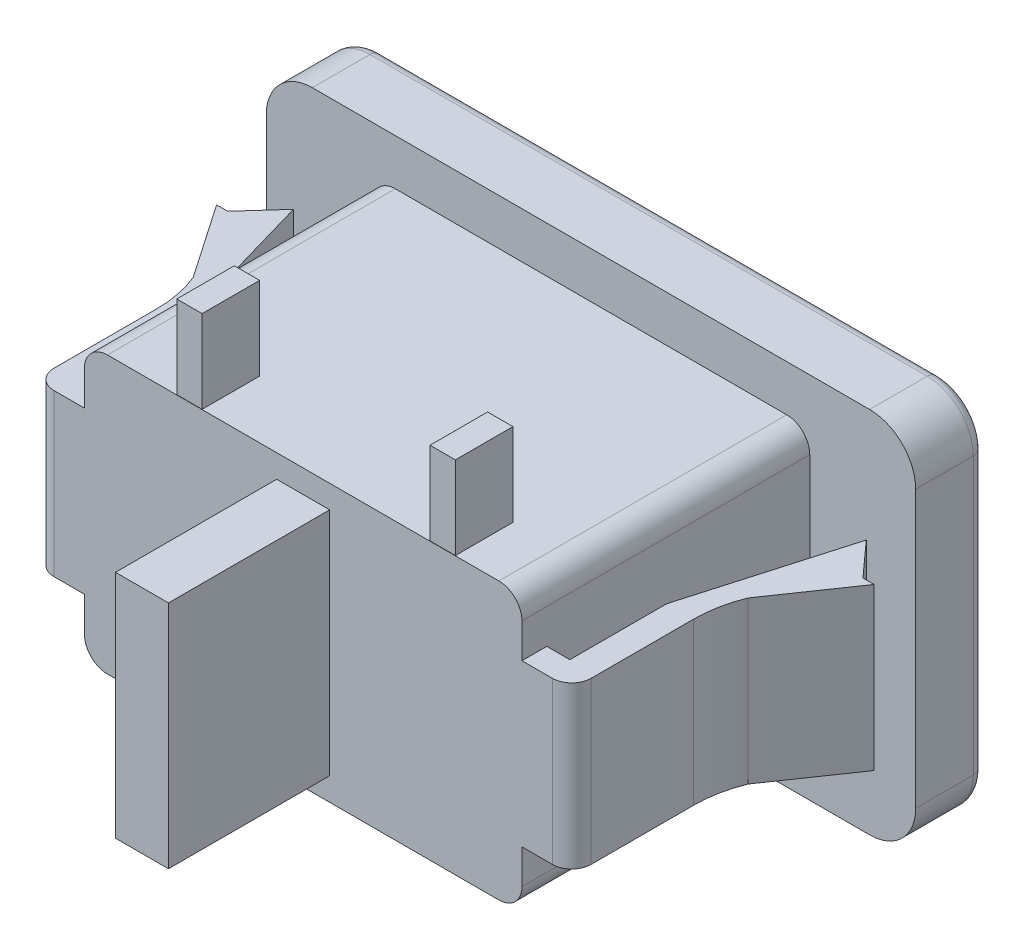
ISO-10303-21;
HEADER;
FILE_DESCRIPTION(('STEP AP214'),'2;1');
FILE_NAME('part.step','',(''),(''),'','','');
FILE_SCHEMA(('AUTOMOTIVE_DESIGN { 1 0 10303 214 1 1 1 1 }'));
ENDSEC;
DATA;
#1=APPLICATION_CONTEXT('core data for automotive mechanical design processes');
#2=APPLICATION_PROTOCOL_DEFINITION('international standard','automotive_design',2000,#1);
#3=PRODUCT_CONTEXT('',#1,'mechanical');
#4=PRODUCT('Part','Part','',(#3));
#5=PRODUCT_RELATED_PRODUCT_CATEGORY('part','',(#4));
#6=PRODUCT_DEFINITION_FORMATION('','',#4);
#7=PRODUCT_DEFINITION_CONTEXT('part definition',#1,'design');
#8=PRODUCT_DEFINITION('design','',#6,#7);
#9=PRODUCT_DEFINITION_SHAPE('','',#8);
#10=(LENGTH_UNIT() NAMED_UNIT(*) SI_UNIT(.MILLI.,.METRE.));
#11=(NAMED_UNIT(*) PLANE_ANGLE_UNIT() SI_UNIT($,.RADIAN.));
#12=(NAMED_UNIT(*) SI_UNIT($,.STERADIAN.) SOLID_ANGLE_UNIT());
#13=UNCERTAINTY_MEASURE_WITH_UNIT(LENGTH_MEASURE(1.E-05),#10,'distance_accuracy_value','');
#14=(GEOMETRIC_REPRESENTATION_CONTEXT(3) GLOBAL_UNCERTAINTY_ASSIGNED_CONTEXT((#13)) GLOBAL_UNIT_ASSIGNED_CONTEXT((#10,
#11,#12)) REPRESENTATION_CONTEXT('',''));
#15=CARTESIAN_POINT('',(0.,0.,0.));
#16=DIRECTION('',(0.,0.,1.));
#17=DIRECTION('',(1.,0.,0.));
#18=AXIS2_PLACEMENT_3D('',#15,#16,#17);
#19=CARTESIAN_POINT('',(-8.49999999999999,6.,12.5));
#20=DIRECTION('',(0.,-1.,0.));
#21=DIRECTION('',(0.,0.,-1.));
#22=AXIS2_PLACEMENT_3D('',#19,#20,#21);
#23=PLANE('',#22);
#24=DIRECTION('',(0.,0.,-1.));
#25=VECTOR('',#24,1.);
#26=CARTESIAN_POINT('',(6.6,6.,12.49));
#27=LINE('',#26,#25);
#28=CARTESIAN_POINT('',(6.6,6.,12.49));
#29=VERTEX_POINT('',#28);
#30=CARTESIAN_POINT('',(6.6,6.,9.99));
#31=VERTEX_POINT('',#30);
#32=EDGE_CURVE('E496',#29,#31,#27,.T.);
#33=ORIENTED_EDGE('',*,*,#32,.F.);
#34=DIRECTION('',(1.,0.,0.));
#35=VECTOR('',#34,1.);
#36=CARTESIAN_POINT('',(6.6,6.,12.49));
#37=LINE('',#36,#35);
#38=CARTESIAN_POINT('',(5.5,6.,12.49));
#39=VERTEX_POINT('',#38);
#40=EDGE_CURVE('E509',#39,#29,#37,.T.);
#41=ORIENTED_EDGE('',*,*,#40,.F.);
#42=DIRECTION('',(0.,0.,1.));
#43=VECTOR('',#42,1.);
#44=CARTESIAN_POINT('',(5.5,6.,12.49));
#45=LINE('',#44,#43);
#46=CARTESIAN_POINT('',(5.5,6.,9.99));
#47=VERTEX_POINT('',#46);
#48=EDGE_CURVE('E518',#47,#39,#45,.T.);
#49=ORIENTED_EDGE('',*,*,#48,.F.);
#50=DIRECTION('',(-1.,0.,0.));
#51=VECTOR('',#50,1.);
#52=CARTESIAN_POINT('',(6.6,6.,9.99));
#53=LINE('',#52,#51);
#54=EDGE_CURVE('E499',#31,#47,#53,.T.);
#55=ORIENTED_EDGE('',*,*,#54,.F.);
#56=EDGE_LOOP('',(#33,#41,#49,#55));
#57=FACE_BOUND('',#56,.T.);
#58=DIRECTION('',(-1.,0.,0.));
#59=VECTOR('',#58,1.);
#60=CARTESIAN_POINT('',(-8.49999999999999,6.,0.));
#61=LINE('',#60,#59);
#62=CARTESIAN_POINT('',(8.49999999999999,6.,0.));
#63=VERTEX_POINT('',#62);
#64=CARTESIAN_POINT('',(-8.49999999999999,6.,0.));
#65=VERTEX_POINT('',#64);
#66=EDGE_CURVE('E891',#63,#65,#61,.T.);
#67=ORIENTED_EDGE('',*,*,#66,.T.);
#68=DIRECTION('',(0.,0.,-1.));
#69=VECTOR('',#68,1.);
#70=CARTESIAN_POINT('',(-8.49999999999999,6.,12.5));
#71=LINE('',#70,#69);
#72=CARTESIAN_POINT('',(-8.49999999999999,6.,12.5));
#73=VERTEX_POINT('',#72);
#74=EDGE_CURVE('E904',#73,#65,#71,.T.);
#75=ORIENTED_EDGE('',*,*,#74,.F.);
#76=DIRECTION('',(-1.,0.,0.));
#77=VECTOR('',#76,1.);
#78=CARTESIAN_POINT('',(-8.49999999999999,6.,12.5));
#79=LINE('',#78,#77);
#80=CARTESIAN_POINT('',(8.49999999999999,6.,12.5));
#81=VERTEX_POINT('',#80);
#82=EDGE_CURVE('E868',#81,#73,#79,.T.);
#83=ORIENTED_EDGE('',*,*,#82,.F.);
#84=DIRECTION('',(0.,0.,-1.));
#85=VECTOR('',#84,1.);
#86=CARTESIAN_POINT('',(8.49999999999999,6.,12.5));
#87=LINE('',#86,#85);
#88=EDGE_CURVE('E907',#81,#63,#87,.T.);
#89=ORIENTED_EDGE('',*,*,#88,.T.);
#90=EDGE_LOOP('',(#67,#75,#83,#89));
#91=FACE_BOUND('',#90,.T.);
#92=DIRECTION('',(1.,0.,0.));
#93=VECTOR('',#92,1.);
#94=CARTESIAN_POINT('',(-4.4,6.,12.4900000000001));
#95=LINE('',#94,#93);
#96=CARTESIAN_POINT('',(-5.5,6.,12.4900000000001));
#97=VERTEX_POINT('',#96);
#98=CARTESIAN_POINT('',(-4.4,6.,12.4900000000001));
#99=VERTEX_POINT('',#98);
#100=EDGE_CURVE('E495',#97,#99,#95,.T.);
#101=ORIENTED_EDGE('',*,*,#100,.F.);
#102=DIRECTION('',(0.,0.,1.));
#103=VECTOR('',#102,1.);
#104=CARTESIAN_POINT('',(-5.5,6.,12.4900000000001));
#105=LINE('',#104,#103);
#106=CARTESIAN_POINT('',(-5.5,6.,9.99000000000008));
#107=VERTEX_POINT('',#106);
#108=EDGE_CURVE('E492',#107,#97,#105,.T.);
#109=ORIENTED_EDGE('',*,*,#108,.F.);
#110=DIRECTION('',(-1.,0.,0.));
#111=VECTOR('',#110,1.);
#112=CARTESIAN_POINT('',(-4.4,6.,9.99000000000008));
#113=LINE('',#112,#111);
#114=CARTESIAN_POINT('',(-4.4,6.,9.99000000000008));
#115=VERTEX_POINT('',#114);
#116=EDGE_CURVE('E59',#115,#107,#113,.T.);
#117=ORIENTED_EDGE('',*,*,#116,.F.);
#118=DIRECTION('',(0.,0.,-1.));
#119=VECTOR('',#118,1.);
#120=CARTESIAN_POINT('',(-4.4,6.,12.4900000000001));
#121=LINE('',#120,#119);
#122=EDGE_CURVE('E54',#99,#115,#121,.T.);
#123=ORIENTED_EDGE('',*,*,#122,.F.);
#124=EDGE_LOOP('',(#101,#109,#117,#123));
#125=FACE_BOUND('',#124,.T.);
#126=ADVANCED_FACE('F37',(#57,#91,#125),#23,.F.);
#127=CARTESIAN_POINT('',(12.1,6.,7.15));
#128=DIRECTION('',(0.,0.,-1.));
#129=DIRECTION('',(-1.,0.,0.));
#130=AXIS2_PLACEMENT_3D('',#127,#128,#129);
#131=PLANE('',#130);
#132=CARTESIAN_POINT('',(-4.3,0.,7.15));
#133=DIRECTION('',(0.,0.,-1.));
#134=DIRECTION('',(-1.,0.,0.));
#135=AXIS2_PLACEMENT_3D('',#132,#133,#134);
#136=CIRCLE('',#135,3.15);
#137=CARTESIAN_POINT('',(-7.45,0.,7.15));
#138=VERTEX_POINT('',#137);
#139=EDGE_CURVE('E541',#138,#138,#136,.T.);
#140=ORIENTED_EDGE('',*,*,#139,.T.);
#141=EDGE_LOOP('',(#140));
#142=FACE_BOUND('',#141,.T.);
#143=CARTESIAN_POINT('',(-4.3,0.,7.15));
#144=DIRECTION('',(0.,0.,-1.));
#145=DIRECTION('',(-1.,0.,0.));
#146=AXIS2_PLACEMENT_3D('',#143,#144,#145);
#147=CIRCLE('',#146,1.18);
#148=CARTESIAN_POINT('',(-5.48,0.,7.15));
#149=VERTEX_POINT('',#148);
#150=EDGE_CURVE('E535',#149,#149,#147,.T.);
#151=ORIENTED_EDGE('',*,*,#150,.F.);
#152=EDGE_LOOP('',(#151));
#153=FACE_BOUND('',#152,.T.);
#154=ADVANCED_FACE('F1111',(#142,#153),#131,.T.);
#155=CARTESIAN_POINT('',(12.1,6.,7.15));
#156=DIRECTION('',(0.,0.,-1.));
#157=DIRECTION('',(-1.,0.,0.));
#158=AXIS2_PLACEMENT_3D('',#155,#156,#157);
#159=PLANE('',#158);
#160=CARTESIAN_POINT('',(4.3,0.,7.15));
#161=DIRECTION('',(0.,0.,-1.));
#162=DIRECTION('',(-1.,0.,0.));
#163=AXIS2_PLACEMENT_3D('',#160,#161,#162);
#164=CIRCLE('',#163,3.15);
#165=CARTESIAN_POINT('',(1.15,0.,7.15));
#166=VERTEX_POINT('',#165);
#167=EDGE_CURVE('E544',#166,#166,#164,.T.);
#168=ORIENTED_EDGE('',*,*,#167,.T.);
#169=EDGE_LOOP('',(#168));
#170=FACE_BOUND('',#169,.T.);
#171=CARTESIAN_POINT('',(4.3,0.,7.15));
#172=DIRECTION('',(0.,0.,-1.));
#173=DIRECTION('',(-1.,0.,0.));
#174=AXIS2_PLACEMENT_3D('',#171,#172,#173);
#175=CIRCLE('',#174,1.18);
#176=CARTESIAN_POINT('',(3.12,0.,7.15));
#177=VERTEX_POINT('',#176);
#178=EDGE_CURVE('E538',#177,#177,#175,.T.);
#179=ORIENTED_EDGE('',*,*,#178,.F.);
#180=EDGE_LOOP('',(#179));
#181=FACE_BOUND('',#180,.T.);
#182=ADVANCED_FACE('F1117',(#170,#181),#159,.T.);
#183=CARTESIAN_POINT('',(0.,3.,10.6));
#184=DIRECTION('',(0.,0.,1.));
#185=DIRECTION('',(1.,0.,0.));
#186=AXIS2_PLACEMENT_3D('',#183,#184,#185);
#187=PLANE('',#186);
#188=CARTESIAN_POINT('',(4.3,0.,10.6));
#189=DIRECTION('',(0.,0.,1.));
#190=DIRECTION('',(1.,0.,0.));
#191=AXIS2_PLACEMENT_3D('',#188,#189,#190);
#192=CIRCLE('',#191,3.15);
#193=CARTESIAN_POINT('',(7.45,0.,10.6));
#194=VERTEX_POINT('',#193);
#195=EDGE_CURVE('E949',#194,#194,#192,.F.);
#196=ORIENTED_EDGE('',*,*,#195,.F.);
#197=EDGE_LOOP('',(#196));
#198=FACE_BOUND('',#197,.T.);
#199=CARTESIAN_POINT('',(0.,3.,10.6));
#200=DIRECTION('',(0.,0.,-1.));
#201=DIRECTION('',(1.,0.,0.));
#202=AXIS2_PLACEMENT_3D('',#199,#200,#201);
#203=CIRCLE('',#202,1.);
#204=CARTESIAN_POINT('',(0.86602540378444,2.5,10.6));
#205=VERTEX_POINT('',#204);
#206=CARTESIAN_POINT('',(-0.866025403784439,2.5,10.6));
#207=VERTEX_POINT('',#206);
#208=EDGE_CURVE('E584',#205,#207,#203,.T.);
#209=ORIENTED_EDGE('',*,*,#208,.F.);
#210=DIRECTION('',(-0.499999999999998,-0.86602540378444,0.));
#211=VECTOR('',#210,1.);
#212=CARTESIAN_POINT('',(0.86602540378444,2.5,10.6));
#213=LINE('',#212,#211);
#214=CARTESIAN_POINT('',(1.64544826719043,3.85,10.6));
#215=VERTEX_POINT('',#214);
#216=EDGE_CURVE('E616',#215,#205,#213,.T.);
#217=ORIENTED_EDGE('',*,*,#216,.F.);
#218=CARTESIAN_POINT('',(2.07846096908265,3.6,10.6));
#219=DIRECTION('',(0.,0.,1.));
#220=DIRECTION('',(-1.,0.,0.));
#221=AXIS2_PLACEMENT_3D('',#218,#219,#220);
#222=CIRCLE('',#221,0.5);
#223=CARTESIAN_POINT('',(2.07846096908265,4.1,10.6));
#224=VERTEX_POINT('',#223);
#225=EDGE_CURVE('E614',#224,#215,#222,.T.);
#226=ORIENTED_EDGE('',*,*,#225,.F.);
#227=DIRECTION('',(-1.,0.,0.));
#228=VECTOR('',#227,1.);
#229=CARTESIAN_POINT('',(2.07846096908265,4.1,10.6));
#230=LINE('',#229,#228);
#231=CARTESIAN_POINT('',(4.15,4.1,10.6));
#232=VERTEX_POINT('',#231);
#233=EDGE_CURVE('E612',#232,#224,#230,.T.);
#234=ORIENTED_EDGE('',*,*,#233,.F.);
#235=CARTESIAN_POINT('',(4.15,0.,10.6));
#236=DIRECTION('',(0.,0.,1.));
#237=DIRECTION('',(1.,0.,0.));
#238=AXIS2_PLACEMENT_3D('',#235,#236,#237);
#239=CIRCLE('',#238,4.1);
#240=CARTESIAN_POINT('',(4.15,-4.1,10.6));
#241=VERTEX_POINT('',#240);
#242=EDGE_CURVE('E610',#241,#232,#239,.T.);
#243=ORIENTED_EDGE('',*,*,#242,.F.);
#244=DIRECTION('',(1.,0.,0.));
#245=VECTOR('',#244,1.);
#246=CARTESIAN_POINT('',(2.07846096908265,-4.1,10.6));
#247=LINE('',#246,#245);
#248=CARTESIAN_POINT('',(2.07846096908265,-4.1,10.6));
#249=VERTEX_POINT('',#248);
#250=EDGE_CURVE('E608',#249,#241,#247,.T.);
#251=ORIENTED_EDGE('',*,*,#250,.F.);
#252=CARTESIAN_POINT('',(2.07846096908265,-3.6,10.6));
#253=DIRECTION('',(0.,0.,1.));
#254=DIRECTION('',(1.,0.,0.));
#255=AXIS2_PLACEMENT_3D('',#252,#253,#254);
#256=CIRCLE('',#255,0.5);
#257=CARTESIAN_POINT('',(1.64544826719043,-3.85,10.6));
#258=VERTEX_POINT('',#257);
#259=EDGE_CURVE('E606',#258,#249,#256,.T.);
#260=ORIENTED_EDGE('',*,*,#259,.F.);
#261=DIRECTION('',(0.499999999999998,-0.86602540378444,0.));
#262=VECTOR('',#261,1.);
#263=CARTESIAN_POINT('',(0.86602540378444,-2.5,10.6));
#264=LINE('',#263,#262);
#265=CARTESIAN_POINT('',(0.86602540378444,-2.5,10.6));
#266=VERTEX_POINT('',#265);
#267=EDGE_CURVE('E604',#266,#258,#264,.T.);
#268=ORIENTED_EDGE('',*,*,#267,.F.);
#269=CARTESIAN_POINT('',(0.,-3.,10.6));
#270=DIRECTION('',(0.,0.,-1.));
#271=DIRECTION('',(-1.,0.,0.));
#272=AXIS2_PLACEMENT_3D('',#269,#270,#271);
#273=CIRCLE('',#272,1.);
#274=CARTESIAN_POINT('',(-0.866025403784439,-2.5,10.6));
#275=VERTEX_POINT('',#274);
#276=EDGE_CURVE('E602',#275,#266,#273,.T.);
#277=ORIENTED_EDGE('',*,*,#276,.F.);
#278=DIRECTION('',(0.499999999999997,0.86602540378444,0.));
#279=VECTOR('',#278,1.);
#280=CARTESIAN_POINT('',(-1.64544826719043,-3.85,10.6));
#281=LINE('',#280,#279);
#282=CARTESIAN_POINT('',(-1.64544826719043,-3.85,10.6));
#283=VERTEX_POINT('',#282);
#284=EDGE_CURVE('E600',#283,#275,#281,.T.);
#285=ORIENTED_EDGE('',*,*,#284,.F.);
#286=CARTESIAN_POINT('',(-2.07846096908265,-3.6,10.6));
#287=DIRECTION('',(0.,0.,1.));
#288=DIRECTION('',(-1.,0.,0.));
#289=AXIS2_PLACEMENT_3D('',#286,#287,#288);
#290=CIRCLE('',#289,0.5);
#291=CARTESIAN_POINT('',(-2.07846096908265,-4.1,10.6));
#292=VERTEX_POINT('',#291);
#293=EDGE_CURVE('E598',#292,#283,#290,.T.);
#294=ORIENTED_EDGE('',*,*,#293,.F.);
#295=DIRECTION('',(1.,0.,0.));
#296=VECTOR('',#295,1.);
#297=CARTESIAN_POINT('',(-4.15,-4.1,10.6));
#298=LINE('',#297,#296);
#299=CARTESIAN_POINT('',(-4.15,-4.1,10.6));
#300=VERTEX_POINT('',#299);
#301=EDGE_CURVE('E596',#300,#292,#298,.T.);
#302=ORIENTED_EDGE('',*,*,#301,.F.);
#303=CARTESIAN_POINT('',(-4.15,0.,10.6));
#304=DIRECTION('',(0.,0.,1.));
#305=DIRECTION('',(1.,0.,0.));
#306=AXIS2_PLACEMENT_3D('',#303,#304,#305);
#307=CIRCLE('',#306,4.1);
#308=CARTESIAN_POINT('',(-4.15,4.1,10.6));
#309=VERTEX_POINT('',#308);
#310=EDGE_CURVE('E594',#309,#300,#307,.T.);
#311=ORIENTED_EDGE('',*,*,#310,.F.);
#312=DIRECTION('',(-1.,0.,0.));
#313=VECTOR('',#312,1.);
#314=CARTESIAN_POINT('',(-4.15,4.1,10.6));
#315=LINE('',#314,#313);
#316=CARTESIAN_POINT('',(-2.07846096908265,4.1,10.6));
#317=VERTEX_POINT('',#316);
#318=EDGE_CURVE('E592',#317,#309,#315,.T.);
#319=ORIENTED_EDGE('',*,*,#318,.F.);
#320=CARTESIAN_POINT('',(-2.07846096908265,3.6,10.6));
#321=DIRECTION('',(0.,0.,1.));
#322=DIRECTION('',(1.,0.,0.));
#323=AXIS2_PLACEMENT_3D('',#320,#321,#322);
#324=CIRCLE('',#323,0.5);
#325=CARTESIAN_POINT('',(-1.64544826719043,3.85,10.6));
#326=VERTEX_POINT('',#325);
#327=EDGE_CURVE('E590',#326,#317,#324,.T.);
#328=ORIENTED_EDGE('',*,*,#327,.F.);
#329=DIRECTION('',(-0.499999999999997,0.86602540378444,0.));
#330=VECTOR('',#329,1.);
#331=CARTESIAN_POINT('',(-1.64544826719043,3.85,10.6));
#332=LINE('',#331,#330);
#333=EDGE_CURVE('E587',#207,#326,#332,.T.);
#334=ORIENTED_EDGE('',*,*,#333,.F.);
#335=EDGE_LOOP('',(#209,#217,#226,#234,#243,#251,#260,#268,#277,#285,#294,#302,#311,#319,#328,#334));
#336=FACE_BOUND('',#335,.T.);
#337=CARTESIAN_POINT('',(-4.3,0.,10.6));
#338=DIRECTION('',(0.,0.,1.));
#339=DIRECTION('',(1.,0.,0.));
#340=AXIS2_PLACEMENT_3D('',#337,#338,#339);
#341=CIRCLE('',#340,3.15);
#342=CARTESIAN_POINT('',(-1.15,0.,10.6));
#343=VERTEX_POINT('',#342);
#344=EDGE_CURVE('E965',#343,#343,#341,.F.);
#345=ORIENTED_EDGE('',*,*,#344,.F.);
#346=EDGE_LOOP('',(#345));
#347=FACE_BOUND('',#346,.T.);
#348=ADVANCED_FACE('F1789',(#198,#336,#347),#187,.F.);
#349=CARTESIAN_POINT('',(-8.5,-5.,12.5));
#350=DIRECTION('',(0.,0.,-1.));
#351=DIRECTION('',(-1.,0.,0.));
#352=AXIS2_PLACEMENT_3D('',#349,#350,#351);
#353=PLANE('',#352);
#354=CARTESIAN_POINT('',(-8.5,-5.,12.5));
#355=DIRECTION('',(0.,0.,1.));
#356=DIRECTION('',(-1.,0.,0.));
#357=AXIS2_PLACEMENT_3D('',#354,#355,#356);
#358=CIRCLE('',#357,1.);
#359=CARTESIAN_POINT('',(-9.5,-4.99999999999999,12.5));
#360=VERTEX_POINT('',#359);
#361=CARTESIAN_POINT('',(-8.49999999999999,-6.,12.5));
#362=VERTEX_POINT('',#361);
#363=EDGE_CURVE('E854',#360,#362,#358,.T.);
#364=ORIENTED_EDGE('',*,*,#363,.T.);
#365=DIRECTION('',(1.,0.,0.));
#366=VECTOR('',#365,1.);
#367=CARTESIAN_POINT('',(-8.49999999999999,-6.,12.5));
#368=LINE('',#367,#366);
#369=CARTESIAN_POINT('',(8.49999999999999,-6.,12.5));
#370=VERTEX_POINT('',#369);
#371=EDGE_CURVE('E857',#362,#370,#368,.T.);
#372=ORIENTED_EDGE('',*,*,#371,.T.);
#373=CARTESIAN_POINT('',(8.5,-5.,12.5));
#374=DIRECTION('',(0.,0.,1.));
#375=DIRECTION('',(1.,0.,0.));
#376=AXIS2_PLACEMENT_3D('',#373,#374,#375);
#377=CIRCLE('',#376,1.);
#378=CARTESIAN_POINT('',(9.5,-4.99999999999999,12.5));
#379=VERTEX_POINT('',#378);
#380=EDGE_CURVE('E860',#370,#379,#377,.T.);
#381=ORIENTED_EDGE('',*,*,#380,.T.);
#382=DIRECTION('',(0.,1.,0.));
#383=VECTOR('',#382,1.);
#384=CARTESIAN_POINT('',(9.5,-4.99999999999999,12.5));
#385=LINE('',#384,#383);
#386=CARTESIAN_POINT('',(9.5,-3.5,12.5));
#387=VERTEX_POINT('',#386);
#388=EDGE_CURVE('E863',#379,#387,#385,.T.);
#389=ORIENTED_EDGE('',*,*,#388,.T.);
#390=DIRECTION('',(1.,0.,0.));
#391=VECTOR('',#390,1.);
#392=CARTESIAN_POINT('',(9.5,-3.5,12.5));
#393=LINE('',#392,#391);
#394=CARTESIAN_POINT('',(10.821804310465,-3.5,12.5));
#395=VERTEX_POINT('',#394);
#396=EDGE_CURVE('E811',#387,#395,#393,.T.);
#397=ORIENTED_EDGE('',*,*,#396,.T.);
#398=DIRECTION('',(0.,-1.,0.));
#399=VECTOR('',#398,1.);
#400=CARTESIAN_POINT('',(10.821804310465,3.5,12.5));
#401=LINE('',#400,#399);
#402=CARTESIAN_POINT('',(10.821804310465,3.5,12.5));
#403=VERTEX_POINT('',#402);
#404=EDGE_CURVE('E841',#403,#395,#401,.T.);
#405=ORIENTED_EDGE('',*,*,#404,.F.);
#406=DIRECTION('',(1.,0.,0.));
#407=VECTOR('',#406,1.);
#408=CARTESIAN_POINT('',(9.5,3.5,12.5));
#409=LINE('',#408,#407);
#410=CARTESIAN_POINT('',(9.5,3.5,12.5));
#411=VERTEX_POINT('',#410);
#412=EDGE_CURVE('E787',#411,#403,#409,.T.);
#413=ORIENTED_EDGE('',*,*,#412,.F.);
#414=CARTESIAN_POINT('',(9.5,4.99999999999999,12.5));
#415=VERTEX_POINT('',#414);
#416=EDGE_CURVE('E862',#411,#415,#385,.T.);
#417=ORIENTED_EDGE('',*,*,#416,.T.);
#418=CARTESIAN_POINT('',(8.5,5.,12.5));
#419=DIRECTION('',(0.,0.,1.));
#420=DIRECTION('',(-1.,0.,0.));
#421=AXIS2_PLACEMENT_3D('',#418,#419,#420);
#422=CIRCLE('',#421,1.);
#423=EDGE_CURVE('E866',#415,#81,#422,.T.);
#424=ORIENTED_EDGE('',*,*,#423,.T.);
#425=ORIENTED_EDGE('',*,*,#82,.T.);
#426=CARTESIAN_POINT('',(-8.5,5.,12.5));
#427=DIRECTION('',(0.,0.,1.));
#428=DIRECTION('',(-1.,0.,0.));
#429=AXIS2_PLACEMENT_3D('',#426,#427,#428);
#430=CIRCLE('',#429,1.);
#431=CARTESIAN_POINT('',(-9.5,4.99999999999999,12.5));
#432=VERTEX_POINT('',#431);
#433=EDGE_CURVE('E870',#73,#432,#430,.T.);
#434=ORIENTED_EDGE('',*,*,#433,.T.);
#435=DIRECTION('',(0.,-1.,0.));
#436=VECTOR('',#435,1.);
#437=CARTESIAN_POINT('',(-9.5,-4.99999999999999,12.5));
#438=LINE('',#437,#436);
#439=CARTESIAN_POINT('',(-9.5,3.5,12.5));
#440=VERTEX_POINT('',#439);
#441=EDGE_CURVE('E873',#432,#440,#438,.T.);
#442=ORIENTED_EDGE('',*,*,#441,.T.);
#443=DIRECTION('',(1.,0.,0.));
#444=VECTOR('',#443,1.);
#445=CARTESIAN_POINT('',(-9.5,3.5,12.5));
#446=LINE('',#445,#444);
#447=CARTESIAN_POINT('',(-10.821804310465,3.5,12.5));
#448=VERTEX_POINT('',#447);
#449=EDGE_CURVE('E702',#448,#440,#446,.T.);
#450=ORIENTED_EDGE('',*,*,#449,.F.);
#451=DIRECTION('',(0.,-1.,0.));
#452=VECTOR('',#451,1.);
#453=CARTESIAN_POINT('',(-10.821804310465,3.5,12.5));
#454=LINE('',#453,#452);
#455=CARTESIAN_POINT('',(-10.821804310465,-3.5,12.5));
#456=VERTEX_POINT('',#455);
#457=EDGE_CURVE('E772',#448,#456,#454,.T.);
#458=ORIENTED_EDGE('',*,*,#457,.T.);
#459=DIRECTION('',(1.,0.,0.));
#460=VECTOR('',#459,1.);
#461=CARTESIAN_POINT('',(-9.5,-3.5,12.5));
#462=LINE('',#461,#460);
#463=CARTESIAN_POINT('',(-9.5,-3.5,12.5));
#464=VERTEX_POINT('',#463);
#465=EDGE_CURVE('E726',#456,#464,#462,.T.);
#466=ORIENTED_EDGE('',*,*,#465,.T.);
#467=EDGE_CURVE('E872',#464,#360,#438,.T.);
#468=ORIENTED_EDGE('',*,*,#467,.T.);
#469=EDGE_LOOP('',(#364,#372,#381,#389,#397,#405,#413,#417,#424,#425,#434,#442,#450,#458,#466,#468));
#470=FACE_BOUND('',#469,.T.);
#471=DIRECTION('',(1.,0.,0.));
#472=VECTOR('',#471,1.);
#473=CARTESIAN_POINT('',(-1.15,-5.,12.5));
#474=LINE('',#473,#472);
#475=CARTESIAN_POINT('',(-1.15,-5.,12.5));
#476=VERTEX_POINT('',#475);
#477=CARTESIAN_POINT('',(1.15,-5.,12.5));
#478=VERTEX_POINT('',#477);
#479=EDGE_CURVE('E567',#476,#478,#474,.T.);
#480=ORIENTED_EDGE('',*,*,#479,.F.);
#481=DIRECTION('',(0.,-1.,0.));
#482=VECTOR('',#481,1.);
#483=CARTESIAN_POINT('',(-1.15,-5.,12.5));
#484=LINE('',#483,#482);
#485=CARTESIAN_POINT('',(-1.15,5.,12.5));
#486=VERTEX_POINT('',#485);
#487=EDGE_CURVE('E564',#486,#476,#484,.T.);
#488=ORIENTED_EDGE('',*,*,#487,.F.);
#489=DIRECTION('',(-1.,0.,0.));
#490=VECTOR('',#489,1.);
#491=CARTESIAN_POINT('',(-1.15,5.,12.5));
#492=LINE('',#491,#490);
#493=CARTESIAN_POINT('',(1.15,5.,12.5));
#494=VERTEX_POINT('',#493);
#495=EDGE_CURVE('E561',#494,#486,#492,.T.);
#496=ORIENTED_EDGE('',*,*,#495,.F.);
#497=DIRECTION('',(0.,1.,0.));
#498=VECTOR('',#497,1.);
#499=CARTESIAN_POINT('',(1.15,-5.,12.5));
#500=LINE('',#499,#498);
#501=EDGE_CURVE('E547',#478,#494,#500,.T.);
#502=ORIENTED_EDGE('',*,*,#501,.F.);
#503=EDGE_LOOP('',(#480,#488,#496,#502));
#504=FACE_BOUND('',#503,.T.);
#505=ADVANCED_FACE('F1146',(#470,#504),#353,.F.);
#506=CARTESIAN_POINT('',(12.1,6.,-3.));
#507=DIRECTION('',(0.,0.,-1.));
#508=DIRECTION('',(-1.,0.,0.));
#509=AXIS2_PLACEMENT_3D('',#506,#507,#508);
#510=PLANE('',#509);
#511=DIRECTION('',(0.,1.,0.));
#512=VECTOR('',#511,1.);
#513=CARTESIAN_POINT('',(13.6,6.,-3.));
#514=LINE('',#513,#512);
#515=CARTESIAN_POINT('',(13.6,5.99999999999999,-3.));
#516=VERTEX_POINT('',#515);
#517=CARTESIAN_POINT('',(13.6,-5.99999999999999,-3.));
#518=VERTEX_POINT('',#517);
#519=EDGE_CURVE('E977',#516,#518,#514,.F.);
#520=ORIENTED_EDGE('',*,*,#519,.T.);
#521=CARTESIAN_POINT('',(12.1,-6.,-3.));
#522=DIRECTION('',(0.,0.,-1.));
#523=DIRECTION('',(-1.,0.,0.));
#524=AXIS2_PLACEMENT_3D('',#521,#522,#523);
#525=CIRCLE('',#524,1.5);
#526=CARTESIAN_POINT('',(12.1,-7.5,-3.));
#527=VERTEX_POINT('',#526);
#528=EDGE_CURVE('E991',#518,#527,#525,.T.);
#529=ORIENTED_EDGE('',*,*,#528,.T.);
#530=DIRECTION('',(1.,0.,0.));
#531=VECTOR('',#530,1.);
#532=CARTESIAN_POINT('',(12.1,-7.5,-3.));
#533=LINE('',#532,#531);
#534=CARTESIAN_POINT('',(-12.1,-7.5,-3.));
#535=VERTEX_POINT('',#534);
#536=EDGE_CURVE('E989',#527,#535,#533,.F.);
#537=ORIENTED_EDGE('',*,*,#536,.T.);
#538=CARTESIAN_POINT('',(-12.1,-6.,-3.));
#539=DIRECTION('',(0.,0.,-1.));
#540=DIRECTION('',(-1.,0.,0.));
#541=AXIS2_PLACEMENT_3D('',#538,#539,#540);
#542=CIRCLE('',#541,1.5);
#543=CARTESIAN_POINT('',(-13.6,-5.99999999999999,-3.));
#544=VERTEX_POINT('',#543);
#545=EDGE_CURVE('E987',#535,#544,#542,.T.);
#546=ORIENTED_EDGE('',*,*,#545,.T.);
#547=DIRECTION('',(0.,-1.,0.));
#548=VECTOR('',#547,1.);
#549=CARTESIAN_POINT('',(-13.6,6.,-3.));
#550=LINE('',#549,#548);
#551=CARTESIAN_POINT('',(-13.6,5.99999999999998,-3.));
#552=VERTEX_POINT('',#551);
#553=EDGE_CURVE('E985',#544,#552,#550,.F.);
#554=ORIENTED_EDGE('',*,*,#553,.T.);
#555=CARTESIAN_POINT('',(-12.1,6.,-3.));
#556=DIRECTION('',(0.,0.,-1.));
#557=DIRECTION('',(-1.,0.,0.));
#558=AXIS2_PLACEMENT_3D('',#555,#556,#557);
#559=CIRCLE('',#558,1.5);
#560=CARTESIAN_POINT('',(-12.1,7.5,-3.));
#561=VERTEX_POINT('',#560);
#562=EDGE_CURVE('E983',#552,#561,#559,.T.);
#563=ORIENTED_EDGE('',*,*,#562,.T.);
#564=DIRECTION('',(-1.,0.,0.));
#565=VECTOR('',#564,1.);
#566=CARTESIAN_POINT('',(12.1,7.5,-3.));
#567=LINE('',#566,#565);
#568=CARTESIAN_POINT('',(12.1,7.5,-3.));
#569=VERTEX_POINT('',#568);
#570=EDGE_CURVE('E981',#561,#569,#567,.F.);
#571=ORIENTED_EDGE('',*,*,#570,.T.);
#572=CARTESIAN_POINT('',(12.1,6.,-3.));
#573=DIRECTION('',(0.,0.,-1.));
#574=DIRECTION('',(-1.,0.,0.));
#575=AXIS2_PLACEMENT_3D('',#572,#573,#574);
#576=CIRCLE('',#575,1.5);
#577=EDGE_CURVE('E979',#569,#516,#576,.T.);
#578=ORIENTED_EDGE('',*,*,#577,.T.);
#579=EDGE_LOOP('',(#520,#529,#537,#546,#554,#563,#571,#578));
#580=FACE_BOUND('',#579,.T.);
#581=DIRECTION('',(-0.499999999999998,-0.86602540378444,0.));
#582=VECTOR('',#581,1.);
#583=CARTESIAN_POINT('',(0.86602540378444,2.5,-3.));
#584=LINE('',#583,#582);
#585=CARTESIAN_POINT('',(1.64544826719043,3.85,-3.));
#586=VERTEX_POINT('',#585);
#587=CARTESIAN_POINT('',(0.86602540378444,2.5,-3.));
#588=VERTEX_POINT('',#587);
#589=EDGE_CURVE('E588',#586,#588,#584,.T.);
#590=ORIENTED_EDGE('',*,*,#589,.T.);
#591=CARTESIAN_POINT('',(0.,3.,-3.));
#592=DIRECTION('',(0.,0.,-1.));
#593=DIRECTION('',(1.,0.,0.));
#594=AXIS2_PLACEMENT_3D('',#591,#592,#593);
#595=CIRCLE('',#594,1.);
#596=CARTESIAN_POINT('',(-0.866025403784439,2.5,-3.));
#597=VERTEX_POINT('',#596);
#598=EDGE_CURVE('E558',#588,#597,#595,.T.);
#599=ORIENTED_EDGE('',*,*,#598,.T.);
#600=DIRECTION('',(-0.499999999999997,0.86602540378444,0.));
#601=VECTOR('',#600,1.);
#602=CARTESIAN_POINT('',(-1.64544826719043,3.85,-3.));
#603=LINE('',#602,#601);
#604=CARTESIAN_POINT('',(-1.64544826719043,3.85,-3.));
#605=VERTEX_POINT('',#604);
#606=EDGE_CURVE('E621',#597,#605,#603,.T.);
#607=ORIENTED_EDGE('',*,*,#606,.T.);
#608=CARTESIAN_POINT('',(-2.07846096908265,3.6,-3.));
#609=DIRECTION('',(0.,0.,1.));
#610=DIRECTION('',(1.,0.,0.));
#611=AXIS2_PLACEMENT_3D('',#608,#609,#610);
#612=CIRCLE('',#611,0.5);
#613=CARTESIAN_POINT('',(-2.07846096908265,4.1,-3.));
#614=VERTEX_POINT('',#613);
#615=EDGE_CURVE('E624',#605,#614,#612,.T.);
#616=ORIENTED_EDGE('',*,*,#615,.T.);
#617=DIRECTION('',(-1.,0.,0.));
#618=VECTOR('',#617,1.);
#619=CARTESIAN_POINT('',(-4.15,4.1,-3.));
#620=LINE('',#619,#618);
#621=CARTESIAN_POINT('',(-4.15,4.1,-3.));
#622=VERTEX_POINT('',#621);
#623=EDGE_CURVE('E627',#614,#622,#620,.T.);
#624=ORIENTED_EDGE('',*,*,#623,.T.);
#625=CARTESIAN_POINT('',(-4.15,0.,-3.));
#626=DIRECTION('',(0.,0.,1.));
#627=DIRECTION('',(1.,0.,0.));
#628=AXIS2_PLACEMENT_3D('',#625,#626,#627);
#629=CIRCLE('',#628,4.1);
#630=CARTESIAN_POINT('',(-4.15,-4.1,-3.));
#631=VERTEX_POINT('',#630);
#632=EDGE_CURVE('E630',#622,#631,#629,.T.);
#633=ORIENTED_EDGE('',*,*,#632,.T.);
#634=DIRECTION('',(1.,0.,0.));
#635=VECTOR('',#634,1.);
#636=CARTESIAN_POINT('',(-4.15,-4.1,-3.));
#637=LINE('',#636,#635);
#638=CARTESIAN_POINT('',(-2.07846096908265,-4.1,-3.));
#639=VERTEX_POINT('',#638);
#640=EDGE_CURVE('E633',#631,#639,#637,.T.);
#641=ORIENTED_EDGE('',*,*,#640,.T.);
#642=CARTESIAN_POINT('',(-2.07846096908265,-3.6,-3.));
#643=DIRECTION('',(0.,0.,1.));
#644=DIRECTION('',(-1.,0.,0.));
#645=AXIS2_PLACEMENT_3D('',#642,#643,#644);
#646=CIRCLE('',#645,0.5);
#647=CARTESIAN_POINT('',(-1.64544826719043,-3.85,-3.));
#648=VERTEX_POINT('',#647);
#649=EDGE_CURVE('E636',#639,#648,#646,.T.);
#650=ORIENTED_EDGE('',*,*,#649,.T.);
#651=DIRECTION('',(0.499999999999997,0.86602540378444,0.));
#652=VECTOR('',#651,1.);
#653=CARTESIAN_POINT('',(-1.64544826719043,-3.85,-3.));
#654=LINE('',#653,#652);
#655=CARTESIAN_POINT('',(-0.866025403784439,-2.5,-3.));
#656=VERTEX_POINT('',#655);
#657=EDGE_CURVE('E639',#648,#656,#654,.T.);
#658=ORIENTED_EDGE('',*,*,#657,.T.);
#659=CARTESIAN_POINT('',(0.,-3.,-3.));
#660=DIRECTION('',(0.,0.,-1.));
#661=DIRECTION('',(-1.,0.,0.));
#662=AXIS2_PLACEMENT_3D('',#659,#660,#661);
#663=CIRCLE('',#662,1.);
#664=CARTESIAN_POINT('',(0.86602540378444,-2.5,-3.));
#665=VERTEX_POINT('',#664);
#666=EDGE_CURVE('E642',#656,#665,#663,.T.);
#667=ORIENTED_EDGE('',*,*,#666,.T.);
#668=DIRECTION('',(0.499999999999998,-0.86602540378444,0.));
#669=VECTOR('',#668,1.);
#670=CARTESIAN_POINT('',(0.86602540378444,-2.5,-3.));
#671=LINE('',#670,#669);
#672=CARTESIAN_POINT('',(1.64544826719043,-3.85,-3.));
#673=VERTEX_POINT('',#672);
#674=EDGE_CURVE('E645',#665,#673,#671,.T.);
#675=ORIENTED_EDGE('',*,*,#674,.T.);
#676=CARTESIAN_POINT('',(2.07846096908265,-3.6,-3.));
#677=DIRECTION('',(0.,0.,1.));
#678=DIRECTION('',(1.,0.,0.));
#679=AXIS2_PLACEMENT_3D('',#676,#677,#678);
#680=CIRCLE('',#679,0.5);
#681=CARTESIAN_POINT('',(2.07846096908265,-4.1,-3.));
#682=VERTEX_POINT('',#681);
#683=EDGE_CURVE('E648',#673,#682,#680,.T.);
#684=ORIENTED_EDGE('',*,*,#683,.T.);
#685=DIRECTION('',(1.,0.,0.));
#686=VECTOR('',#685,1.);
#687=CARTESIAN_POINT('',(2.07846096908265,-4.1,-3.));
#688=LINE('',#687,#686);
#689=CARTESIAN_POINT('',(4.15,-4.1,-3.));
#690=VERTEX_POINT('',#689);
#691=EDGE_CURVE('E651',#682,#690,#688,.T.);
#692=ORIENTED_EDGE('',*,*,#691,.T.);
#693=CARTESIAN_POINT('',(4.15,0.,-3.));
#694=DIRECTION('',(0.,0.,1.));
#695=DIRECTION('',(1.,0.,0.));
#696=AXIS2_PLACEMENT_3D('',#693,#694,#695);
#697=CIRCLE('',#696,4.1);
#698=CARTESIAN_POINT('',(4.15,4.1,-3.));
#699=VERTEX_POINT('',#698);
#700=EDGE_CURVE('E654',#690,#699,#697,.T.);
#701=ORIENTED_EDGE('',*,*,#700,.T.);
#702=DIRECTION('',(-1.,0.,0.));
#703=VECTOR('',#702,1.);
#704=CARTESIAN_POINT('',(2.07846096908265,4.1,-3.));
#705=LINE('',#704,#703);
#706=CARTESIAN_POINT('',(2.07846096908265,4.1,-3.));
#707=VERTEX_POINT('',#706);
#708=EDGE_CURVE('E657',#699,#707,#705,.T.);
#709=ORIENTED_EDGE('',*,*,#708,.T.);
#710=CARTESIAN_POINT('',(2.07846096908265,3.6,-3.));
#711=DIRECTION('',(0.,0.,1.));
#712=DIRECTION('',(-1.,0.,0.));
#713=AXIS2_PLACEMENT_3D('',#710,#711,#712);
#714=CIRCLE('',#713,0.5);
#715=EDGE_CURVE('E660',#707,#586,#714,.T.);
#716=ORIENTED_EDGE('',*,*,#715,.T.);
#717=EDGE_LOOP('',(#590,#599,#607,#616,#624,#633,#641,#650,#658,#667,#675,#684,#692,#701,#709,#716));
#718=FACE_BOUND('',#717,.T.);
#719=ADVANCED_FACE('F1036',(#580,#718),#510,.T.);
#720=CARTESIAN_POINT('',(-9.5,-4.99999999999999,12.5));
#721=DIRECTION('',(1.,0.,0.));
#722=DIRECTION('',(0.,0.,-1.));
#723=AXIS2_PLACEMENT_3D('',#720,#721,#722);
#724=PLANE('',#723);
#725=DIRECTION('',(0.,0.,-1.));
#726=VECTOR('',#725,1.);
#727=CARTESIAN_POINT('',(-9.5,3.5,12.5));
#728=LINE('',#727,#726);
#729=CARTESIAN_POINT('',(-9.5,3.5,11.4212118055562));
#730=VERTEX_POINT('',#729);
#731=EDGE_CURVE('E705',#440,#730,#728,.T.);
#732=ORIENTED_EDGE('',*,*,#731,.F.);
#733=ORIENTED_EDGE('',*,*,#441,.F.);
#734=DIRECTION('',(0.,0.,-1.));
#735=VECTOR('',#734,1.);
#736=CARTESIAN_POINT('',(-9.5,4.99999999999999,12.5));
#737=LINE('',#736,#735);
#738=CARTESIAN_POINT('',(-9.5,4.99999999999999,0.));
#739=VERTEX_POINT('',#738);
#740=EDGE_CURVE('E901',#432,#739,#737,.T.);
#741=ORIENTED_EDGE('',*,*,#740,.T.);
#742=DIRECTION('',(0.,-1.,0.));
#743=VECTOR('',#742,1.);
#744=CARTESIAN_POINT('',(-9.5,-4.99999999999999,0.));
#745=LINE('',#744,#743);
#746=CARTESIAN_POINT('',(-9.5,-4.99999999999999,0.));
#747=VERTEX_POINT('',#746);
#748=EDGE_CURVE('E858',#739,#747,#745,.T.);
#749=ORIENTED_EDGE('',*,*,#748,.T.);
#750=DIRECTION('',(0.,0.,-1.));
#751=VECTOR('',#750,1.);
#752=CARTESIAN_POINT('',(-9.5,-4.99999999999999,12.5));
#753=LINE('',#752,#751);
#754=EDGE_CURVE('E876',#360,#747,#753,.T.);
#755=ORIENTED_EDGE('',*,*,#754,.F.);
#756=ORIENTED_EDGE('',*,*,#467,.F.);
#757=DIRECTION('',(0.,0.,-1.));
#758=VECTOR('',#757,1.);
#759=CARTESIAN_POINT('',(-9.5,-3.5,12.5));
#760=LINE('',#759,#758);
#761=CARTESIAN_POINT('',(-9.5,-3.5,11.4212118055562));
#762=VERTEX_POINT('',#761);
#763=EDGE_CURVE('E729',#464,#762,#760,.T.);
#764=ORIENTED_EDGE('',*,*,#763,.T.);
#765=DIRECTION('',(0.,-1.,0.));
#766=VECTOR('',#765,1.);
#767=CARTESIAN_POINT('',(-9.5,3.5,11.4212118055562));
#768=LINE('',#767,#766);
#769=EDGE_CURVE('E770',#730,#762,#768,.T.);
#770=ORIENTED_EDGE('',*,*,#769,.F.);
#771=EDGE_LOOP('',(#732,#733,#741,#749,#755,#756,#764,#770));
#772=FACE_BOUND('',#771,.T.);
#773=ADVANCED_FACE('F1132',(#772),#724,.F.);
#774=CARTESIAN_POINT('',(9.5,-4.99999999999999,12.5));
#775=DIRECTION('',(-1.,0.,0.));
#776=DIRECTION('',(0.,0.,1.));
#777=AXIS2_PLACEMENT_3D('',#774,#775,#776);
#778=PLANE('',#777);
#779=DIRECTION('',(0.,0.,1.));
#780=VECTOR('',#779,1.);
#781=CARTESIAN_POINT('',(9.5,3.5,12.5));
#782=LINE('',#781,#780);
#783=CARTESIAN_POINT('',(9.5,3.5,11.4212118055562));
#784=VERTEX_POINT('',#783);
#785=EDGE_CURVE('E784',#784,#411,#782,.T.);
#786=ORIENTED_EDGE('',*,*,#785,.F.);
#787=DIRECTION('',(0.,-1.,0.));
#788=VECTOR('',#787,1.);
#789=CARTESIAN_POINT('',(9.5,3.5,11.4212118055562));
#790=LINE('',#789,#788);
#791=CARTESIAN_POINT('',(9.5,-3.5,11.4212118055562));
#792=VERTEX_POINT('',#791);
#793=EDGE_CURVE('E844',#784,#792,#790,.T.);
#794=ORIENTED_EDGE('',*,*,#793,.T.);
#795=DIRECTION('',(0.,0.,1.));
#796=VECTOR('',#795,1.);
#797=CARTESIAN_POINT('',(9.5,-3.5,12.5));
#798=LINE('',#797,#796);
#799=EDGE_CURVE('E808',#792,#387,#798,.T.);
#800=ORIENTED_EDGE('',*,*,#799,.T.);
#801=ORIENTED_EDGE('',*,*,#388,.F.);
#802=DIRECTION('',(0.,0.,-1.));
#803=VECTOR('',#802,1.);
#804=CARTESIAN_POINT('',(9.5,-4.99999999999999,12.5));
#805=LINE('',#804,#803);
#806=CARTESIAN_POINT('',(9.5,-4.99999999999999,0.));
#807=VERTEX_POINT('',#806);
#808=EDGE_CURVE('E913',#379,#807,#805,.T.);
#809=ORIENTED_EDGE('',*,*,#808,.T.);
#810=DIRECTION('',(0.,1.,0.));
#811=VECTOR('',#810,1.);
#812=CARTESIAN_POINT('',(9.5,-4.99999999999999,0.));
#813=LINE('',#812,#811);
#814=CARTESIAN_POINT('',(9.5,4.99999999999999,0.));
#815=VERTEX_POINT('',#814);
#816=EDGE_CURVE('E885',#807,#815,#813,.T.);
#817=ORIENTED_EDGE('',*,*,#816,.T.);
#818=DIRECTION('',(0.,0.,-1.));
#819=VECTOR('',#818,1.);
#820=CARTESIAN_POINT('',(9.5,4.99999999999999,12.5));
#821=LINE('',#820,#819);
#822=EDGE_CURVE('E910',#415,#815,#821,.T.);
#823=ORIENTED_EDGE('',*,*,#822,.F.);
#824=ORIENTED_EDGE('',*,*,#416,.F.);
#825=EDGE_LOOP('',(#786,#794,#800,#801,#809,#817,#823,#824));
#826=FACE_BOUND('',#825,.T.);
#827=ADVANCED_FACE('F1106',(#826),#778,.F.);
#828=CARTESIAN_POINT('',(12.1,6.,0.));
#829=DIRECTION('',(0.,0.,-1.));
#830=DIRECTION('',(-1.,0.,0.));
#831=AXIS2_PLACEMENT_3D('',#828,#829,#830);
#832=PLANE('',#831);
#833=CARTESIAN_POINT('',(12.1,6.,0.));
#834=DIRECTION('',(0.,0.,1.));
#835=DIRECTION('',(-1.,0.,0.));
#836=AXIS2_PLACEMENT_3D('',#833,#834,#835);
#837=CIRCLE('',#836,2.);
#838=CARTESIAN_POINT('',(14.1,5.99999999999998,0.));
#839=VERTEX_POINT('',#838);
#840=CARTESIAN_POINT('',(12.1,8.,0.));
#841=VERTEX_POINT('',#840);
#842=EDGE_CURVE('E922',#839,#841,#837,.T.);
#843=ORIENTED_EDGE('',*,*,#842,.T.);
#844=DIRECTION('',(-1.,0.,0.));
#845=VECTOR('',#844,1.);
#846=CARTESIAN_POINT('',(-12.1,8.,0.));
#847=LINE('',#846,#845);
#848=CARTESIAN_POINT('',(-12.1,8.,0.));
#849=VERTEX_POINT('',#848);
#850=EDGE_CURVE('E925',#841,#849,#847,.T.);
#851=ORIENTED_EDGE('',*,*,#850,.T.);
#852=CARTESIAN_POINT('',(-12.1,6.,0.));
#853=DIRECTION('',(0.,0.,1.));
#854=DIRECTION('',(-1.,0.,0.));
#855=AXIS2_PLACEMENT_3D('',#852,#853,#854);
#856=CIRCLE('',#855,2.);
#857=CARTESIAN_POINT('',(-14.1,5.99999999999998,0.));
#858=VERTEX_POINT('',#857);
#859=EDGE_CURVE('E928',#849,#858,#856,.T.);
#860=ORIENTED_EDGE('',*,*,#859,.T.);
#861=DIRECTION('',(0.,-1.,0.));
#862=VECTOR('',#861,1.);
#863=CARTESIAN_POINT('',(-14.1,-5.99999999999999,0.));
#864=LINE('',#863,#862);
#865=CARTESIAN_POINT('',(-14.1,-5.99999999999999,0.));
#866=VERTEX_POINT('',#865);
#867=EDGE_CURVE('E931',#858,#866,#864,.T.);
#868=ORIENTED_EDGE('',*,*,#867,.T.);
#869=CARTESIAN_POINT('',(-12.1,-6.,0.));
#870=DIRECTION('',(0.,0.,1.));
#871=DIRECTION('',(-1.,0.,0.));
#872=AXIS2_PLACEMENT_3D('',#869,#870,#871);
#873=CIRCLE('',#872,2.);
#874=CARTESIAN_POINT('',(-12.1,-8.,0.));
#875=VERTEX_POINT('',#874);
#876=EDGE_CURVE('E934',#866,#875,#873,.T.);
#877=ORIENTED_EDGE('',*,*,#876,.T.);
#878=DIRECTION('',(1.,0.,0.));
#879=VECTOR('',#878,1.);
#880=CARTESIAN_POINT('',(-12.1,-8.,0.));
#881=LINE('',#880,#879);
#882=CARTESIAN_POINT('',(12.1,-8.,0.));
#883=VERTEX_POINT('',#882);
#884=EDGE_CURVE('E937',#875,#883,#881,.T.);
#885=ORIENTED_EDGE('',*,*,#884,.T.);
#886=CARTESIAN_POINT('',(12.1,-6.,0.));
#887=DIRECTION('',(0.,0.,1.));
#888=DIRECTION('',(1.,0.,0.));
#889=AXIS2_PLACEMENT_3D('',#886,#887,#888);
#890=CIRCLE('',#889,2.);
#891=CARTESIAN_POINT('',(14.1,-5.99999999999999,0.));
#892=VERTEX_POINT('',#891);
#893=EDGE_CURVE('E940',#883,#892,#890,.T.);
#894=ORIENTED_EDGE('',*,*,#893,.T.);
#895=DIRECTION('',(0.,1.,0.));
#896=VECTOR('',#895,1.);
#897=CARTESIAN_POINT('',(14.1,-5.99999999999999,0.));
#898=LINE('',#897,#896);
#899=EDGE_CURVE('E943',#892,#839,#898,.T.);
#900=ORIENTED_EDGE('',*,*,#899,.T.);
#901=EDGE_LOOP('',(#843,#851,#860,#868,#877,#885,#894,#900));
#902=FACE_BOUND('',#901,.T.);
#903=CARTESIAN_POINT('',(-8.5,-5.,0.));
#904=DIRECTION('',(0.,0.,1.));
#905=DIRECTION('',(-1.,0.,0.));
#906=AXIS2_PLACEMENT_3D('',#903,#904,#905);
#907=CIRCLE('',#906,1.);
#908=CARTESIAN_POINT('',(-8.49999999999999,-6.,0.));
#909=VERTEX_POINT('',#908);
#910=EDGE_CURVE('E853',#747,#909,#907,.T.);
#911=ORIENTED_EDGE('',*,*,#910,.F.);
#912=ORIENTED_EDGE('',*,*,#748,.F.);
#913=CARTESIAN_POINT('',(-8.5,5.,0.));
#914=DIRECTION('',(0.,0.,1.));
#915=DIRECTION('',(-1.,0.,0.));
#916=AXIS2_PLACEMENT_3D('',#913,#914,#915);
#917=CIRCLE('',#916,1.);
#918=EDGE_CURVE('E894',#65,#739,#917,.T.);
#919=ORIENTED_EDGE('',*,*,#918,.F.);
#920=ORIENTED_EDGE('',*,*,#66,.F.);
#921=CARTESIAN_POINT('',(8.5,5.,0.));
#922=DIRECTION('',(0.,0.,1.));
#923=DIRECTION('',(-1.,0.,0.));
#924=AXIS2_PLACEMENT_3D('',#921,#922,#923);
#925=CIRCLE('',#924,1.);
#926=EDGE_CURVE('E888',#815,#63,#925,.T.);
#927=ORIENTED_EDGE('',*,*,#926,.F.);
#928=ORIENTED_EDGE('',*,*,#816,.F.);
#929=CARTESIAN_POINT('',(8.5,-5.,0.));
#930=DIRECTION('',(0.,0.,1.));
#931=DIRECTION('',(1.,0.,0.));
#932=AXIS2_PLACEMENT_3D('',#929,#930,#931);
#933=CIRCLE('',#932,1.);
#934=CARTESIAN_POINT('',(8.49999999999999,-6.,0.));
#935=VERTEX_POINT('',#934);
#936=EDGE_CURVE('E882',#935,#807,#933,.T.);
#937=ORIENTED_EDGE('',*,*,#936,.F.);
#938=DIRECTION('',(1.,0.,0.));
#939=VECTOR('',#938,1.);
#940=CARTESIAN_POINT('',(-8.49999999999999,-6.,0.));
#941=LINE('',#940,#939);
#942=EDGE_CURVE('E879',#909,#935,#941,.T.);
#943=ORIENTED_EDGE('',*,*,#942,.F.);
#944=EDGE_LOOP('',(#911,#912,#919,#920,#927,#928,#937,#943));
#945=FACE_BOUND('',#944,.T.);
#946=ADVANCED_FACE('F1061',(#902,#945),#832,.F.);
#947=CARTESIAN_POINT('',(12.1,6.,-3.));
#948=DIRECTION('',(0.,0.,1.));
#949=DIRECTION('',(1.,0.,0.));
#950=AXIS2_PLACEMENT_3D('',#947,#948,#949);
#951=CYLINDRICAL_SURFACE('',#950,2.);
#952=DIRECTION('',(0.,0.,1.));
#953=VECTOR('',#952,1.);
#954=CARTESIAN_POINT('',(14.1,5.99999999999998,-3.));
#955=LINE('',#954,#953);
#956=CARTESIAN_POINT('',(14.1,5.99999999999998,-2.5));
#957=VERTEX_POINT('',#956);
#958=EDGE_CURVE('E947',#957,#839,#955,.T.);
#959=ORIENTED_EDGE('',*,*,#958,.F.);
#960=CARTESIAN_POINT('',(12.1,6.,-2.5));
#961=DIRECTION('',(0.,0.,-1.));
#962=DIRECTION('',(-1.,0.,0.));
#963=AXIS2_PLACEMENT_3D('',#960,#961,#962);
#964=CIRCLE('',#963,2.);
#965=CARTESIAN_POINT('',(12.1,8.,-2.5));
#966=VERTEX_POINT('',#965);
#967=EDGE_CURVE('E46',#957,#966,#964,.F.);
#968=ORIENTED_EDGE('',*,*,#967,.T.);
#969=DIRECTION('',(0.,0.,1.));
#970=VECTOR('',#969,1.);
#971=CARTESIAN_POINT('',(12.1,8.,-3.));
#972=LINE('',#971,#970);
#973=EDGE_CURVE('E946',#966,#841,#972,.T.);
#974=ORIENTED_EDGE('',*,*,#973,.T.);
#975=ORIENTED_EDGE('',*,*,#842,.F.);
#976=EDGE_LOOP('',(#959,#968,#974,#975));
#977=FACE_BOUND('',#976,.T.);
#978=ADVANCED_FACE('F1098',(#977),#951,.T.);
#979=CARTESIAN_POINT('',(14.1,-5.99999999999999,-3.));
#980=DIRECTION('',(1.,0.,0.));
#981=DIRECTION('',(0.,0.,-1.));
#982=AXIS2_PLACEMENT_3D('',#979,#980,#981);
#983=PLANE('',#982);
#984=DIRECTION('',(0.,0.,1.));
#985=VECTOR('',#984,1.);
#986=CARTESIAN_POINT('',(14.1,-5.99999999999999,-3.));
#987=LINE('',#986,#985);
#988=CARTESIAN_POINT('',(14.1,-5.99999999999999,-2.5));
#989=VERTEX_POINT('',#988);
#990=EDGE_CURVE('E950',#989,#892,#987,.T.);
#991=ORIENTED_EDGE('',*,*,#990,.F.);
#992=DIRECTION('',(0.,1.,0.));
#993=VECTOR('',#992,1.);
#994=CARTESIAN_POINT('',(14.1,-5.99999999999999,-2.5));
#995=LINE('',#994,#993);
#996=EDGE_CURVE('E12',#989,#957,#995,.T.);
#997=ORIENTED_EDGE('',*,*,#996,.T.);
#998=ORIENTED_EDGE('',*,*,#958,.T.);
#999=ORIENTED_EDGE('',*,*,#899,.F.);
#1000=EDGE_LOOP('',(#991,#997,#998,#999));
#1001=FACE_BOUND('',#1000,.T.);
#1002=ADVANCED_FACE('F1095',(#1001),#983,.T.);
#1003=CARTESIAN_POINT('',(12.1,-6.,-3.));
#1004=DIRECTION('',(0.,0.,1.));
#1005=DIRECTION('',(1.,0.,0.));
#1006=AXIS2_PLACEMENT_3D('',#1003,#1004,#1005);
#1007=CYLINDRICAL_SURFACE('',#1006,2.);
#1008=DIRECTION('',(0.,0.,1.));
#1009=VECTOR('',#1008,1.);
#1010=CARTESIAN_POINT('',(12.1,-8.,-3.));
#1011=LINE('',#1010,#1009);
#1012=CARTESIAN_POINT('',(12.1,-8.,-2.5));
#1013=VERTEX_POINT('',#1012);
#1014=EDGE_CURVE('E952',#1013,#883,#1011,.T.);
#1015=ORIENTED_EDGE('',*,*,#1014,.F.);
#1016=CARTESIAN_POINT('',(12.1,-6.,-2.5));
#1017=DIRECTION('',(0.,0.,-1.));
#1018=DIRECTION('',(-1.,0.,0.));
#1019=AXIS2_PLACEMENT_3D('',#1016,#1017,#1018);
#1020=CIRCLE('',#1019,2.);
#1021=EDGE_CURVE('E974',#1013,#989,#1020,.F.);
#1022=ORIENTED_EDGE('',*,*,#1021,.T.);
#1023=ORIENTED_EDGE('',*,*,#990,.T.);
#1024=ORIENTED_EDGE('',*,*,#893,.F.);
#1025=EDGE_LOOP('',(#1015,#1022,#1023,#1024));
#1026=FACE_BOUND('',#1025,.T.);
#1027=ADVANCED_FACE('F1057',(#1026),#1007,.T.);
#1028=CARTESIAN_POINT('',(-12.1,-8.,-3.));
#1029=DIRECTION('',(0.,-1.,0.));
#1030=DIRECTION('',(0.,0.,-1.));
#1031=AXIS2_PLACEMENT_3D('',#1028,#1029,#1030);
#1032=PLANE('',#1031);
#1033=DIRECTION('',(0.,0.,1.));
#1034=VECTOR('',#1033,1.);
#1035=CARTESIAN_POINT('',(-12.1,-8.,-3.));
#1036=LINE('',#1035,#1034);
#1037=CARTESIAN_POINT('',(-12.1,-8.,-2.5));
#1038=VERTEX_POINT('',#1037);
#1039=EDGE_CURVE('E954',#1038,#875,#1036,.T.);
#1040=ORIENTED_EDGE('',*,*,#1039,.F.);
#1041=DIRECTION('',(1.,0.,0.));
#1042=VECTOR('',#1041,1.);
#1043=CARTESIAN_POINT('',(-12.1,-8.,-2.5));
#1044=LINE('',#1043,#1042);
#1045=EDGE_CURVE('E994',#1038,#1013,#1044,.T.);
#1046=ORIENTED_EDGE('',*,*,#1045,.T.);
#1047=ORIENTED_EDGE('',*,*,#1014,.T.);
#1048=ORIENTED_EDGE('',*,*,#884,.F.);
#1049=EDGE_LOOP('',(#1040,#1046,#1047,#1048));
#1050=FACE_BOUND('',#1049,.T.);
#1051=ADVANCED_FACE('F1053',(#1050),#1032,.T.);
#1052=CARTESIAN_POINT('',(-12.1,-6.,-3.));
#1053=DIRECTION('',(0.,0.,1.));
#1054=DIRECTION('',(1.,0.,0.));
#1055=AXIS2_PLACEMENT_3D('',#1052,#1053,#1054);
#1056=CYLINDRICAL_SURFACE('',#1055,2.);
#1057=DIRECTION('',(0.,0.,1.));
#1058=VECTOR('',#1057,1.);
#1059=CARTESIAN_POINT('',(-14.1,-5.99999999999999,-3.));
#1060=LINE('',#1059,#1058);
#1061=CARTESIAN_POINT('',(-14.1,-5.99999999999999,-2.5));
#1062=VERTEX_POINT('',#1061);
#1063=EDGE_CURVE('E956',#1062,#866,#1060,.T.);
#1064=ORIENTED_EDGE('',*,*,#1063,.F.);
#1065=CARTESIAN_POINT('',(-12.1,-6.,-2.5));
#1066=DIRECTION('',(0.,0.,-1.));
#1067=DIRECTION('',(-1.,0.,0.));
#1068=AXIS2_PLACEMENT_3D('',#1065,#1066,#1067);
#1069=CIRCLE('',#1068,2.);
#1070=EDGE_CURVE('E996',#1062,#1038,#1069,.F.);
#1071=ORIENTED_EDGE('',*,*,#1070,.T.);
#1072=ORIENTED_EDGE('',*,*,#1039,.T.);
#1073=ORIENTED_EDGE('',*,*,#876,.F.);
#1074=EDGE_LOOP('',(#1064,#1071,#1072,#1073));
#1075=FACE_BOUND('',#1074,.T.);
#1076=ADVANCED_FACE('F1067',(#1075),#1056,.T.);
#1077=CARTESIAN_POINT('',(-14.1,-5.99999999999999,-3.));
#1078=DIRECTION('',(-1.,0.,0.));
#1079=DIRECTION('',(0.,0.,1.));
#1080=AXIS2_PLACEMENT_3D('',#1077,#1078,#1079);
#1081=PLANE('',#1080);
#1082=DIRECTION('',(0.,0.,1.));
#1083=VECTOR('',#1082,1.);
#1084=CARTESIAN_POINT('',(-14.1,5.99999999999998,-3.));
#1085=LINE('',#1084,#1083);
#1086=CARTESIAN_POINT('',(-14.1,5.99999999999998,-2.5));
#1087=VERTEX_POINT('',#1086);
#1088=EDGE_CURVE('E958',#1087,#858,#1085,.T.);
#1089=ORIENTED_EDGE('',*,*,#1088,.F.);
#1090=DIRECTION('',(0.,-1.,0.));
#1091=VECTOR('',#1090,1.);
#1092=CARTESIAN_POINT('',(-14.1,-5.99999999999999,-2.5));
#1093=LINE('',#1092,#1091);
#1094=EDGE_CURVE('E998',#1087,#1062,#1093,.T.);
#1095=ORIENTED_EDGE('',*,*,#1094,.T.);
#1096=ORIENTED_EDGE('',*,*,#1063,.T.);
#1097=ORIENTED_EDGE('',*,*,#867,.F.);
#1098=EDGE_LOOP('',(#1089,#1095,#1096,#1097));
#1099=FACE_BOUND('',#1098,.T.);
#1100=ADVANCED_FACE('F1070',(#1099),#1081,.T.);
#1101=CARTESIAN_POINT('',(-12.1,6.,-3.));
#1102=DIRECTION('',(0.,0.,1.));
#1103=DIRECTION('',(1.,0.,0.));
#1104=AXIS2_PLACEMENT_3D('',#1101,#1102,#1103);
#1105=CYLINDRICAL_SURFACE('',#1104,2.);
#1106=DIRECTION('',(0.,0.,1.));
#1107=VECTOR('',#1106,1.);
#1108=CARTESIAN_POINT('',(-12.1,8.,-3.));
#1109=LINE('',#1108,#1107);
#1110=CARTESIAN_POINT('',(-12.1,8.,-2.5));
#1111=VERTEX_POINT('',#1110);
#1112=EDGE_CURVE('E960',#1111,#849,#1109,.T.);
#1113=ORIENTED_EDGE('',*,*,#1112,.F.);
#1114=CARTESIAN_POINT('',(-12.1,6.,-2.5));
#1115=DIRECTION('',(0.,0.,-1.));
#1116=DIRECTION('',(-1.,0.,0.));
#1117=AXIS2_PLACEMENT_3D('',#1114,#1115,#1116);
#1118=CIRCLE('',#1117,2.);
#1119=EDGE_CURVE('E1000',#1111,#1087,#1118,.F.);
#1120=ORIENTED_EDGE('',*,*,#1119,.T.);
#1121=ORIENTED_EDGE('',*,*,#1088,.T.);
#1122=ORIENTED_EDGE('',*,*,#859,.F.);
#1123=EDGE_LOOP('',(#1113,#1120,#1121,#1122));
#1124=FACE_BOUND('',#1123,.T.);
#1125=ADVANCED_FACE('F1074',(#1124),#1105,.T.);
#1126=CARTESIAN_POINT('',(-12.1,8.,-3.));
#1127=DIRECTION('',(0.,1.,0.));
#1128=DIRECTION('',(0.,0.,1.));
#1129=AXIS2_PLACEMENT_3D('',#1126,#1127,#1128);
#1130=PLANE('',#1129);
#1131=ORIENTED_EDGE('',*,*,#973,.F.);
#1132=DIRECTION('',(-1.,0.,0.));
#1133=VECTOR('',#1132,1.);
#1134=CARTESIAN_POINT('',(-12.1,8.,-2.5));
#1135=LINE('',#1134,#1133);
#1136=EDGE_CURVE('E1002',#966,#1111,#1135,.T.);
#1137=ORIENTED_EDGE('',*,*,#1136,.T.);
#1138=ORIENTED_EDGE('',*,*,#1112,.T.);
#1139=ORIENTED_EDGE('',*,*,#850,.F.);
#1140=EDGE_LOOP('',(#1131,#1137,#1138,#1139));
#1141=FACE_BOUND('',#1140,.T.);
#1142=ADVANCED_FACE('F1078',(#1141),#1130,.T.);
#1143=CARTESIAN_POINT('',(-8.5,-5.,12.5));
#1144=DIRECTION('',(0.,0.,-1.));
#1145=DIRECTION('',(-1.,0.,0.));
#1146=AXIS2_PLACEMENT_3D('',#1143,#1144,#1145);
#1147=CYLINDRICAL_SURFACE('',#1146,1.);
#1148=ORIENTED_EDGE('',*,*,#910,.T.);
#1149=DIRECTION('',(0.,0.,-1.));
#1150=VECTOR('',#1149,1.);
#1151=CARTESIAN_POINT('',(-8.49999999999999,-6.,12.5));
#1152=LINE('',#1151,#1150);
#1153=EDGE_CURVE('E919',#362,#909,#1152,.T.);
#1154=ORIENTED_EDGE('',*,*,#1153,.F.);
#1155=ORIENTED_EDGE('',*,*,#363,.F.);
#1156=ORIENTED_EDGE('',*,*,#754,.T.);
#1157=EDGE_LOOP('',(#1148,#1154,#1155,#1156));
#1158=FACE_BOUND('',#1157,.T.);
#1159=ADVANCED_FACE('F1140',(#1158),#1147,.T.);
#1160=CARTESIAN_POINT('',(-8.49999999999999,-6.,12.5));
#1161=DIRECTION('',(0.,1.,0.));
#1162=DIRECTION('',(0.,0.,1.));
#1163=AXIS2_PLACEMENT_3D('',#1160,#1161,#1162);
#1164=PLANE('',#1163);
#1165=ORIENTED_EDGE('',*,*,#942,.T.);
#1166=DIRECTION('',(0.,0.,-1.));
#1167=VECTOR('',#1166,1.);
#1168=CARTESIAN_POINT('',(8.49999999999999,-6.,12.5));
#1169=LINE('',#1168,#1167);
#1170=EDGE_CURVE('E916',#370,#935,#1169,.T.);
#1171=ORIENTED_EDGE('',*,*,#1170,.F.);
#1172=ORIENTED_EDGE('',*,*,#371,.F.);
#1173=ORIENTED_EDGE('',*,*,#1153,.T.);
#1174=EDGE_LOOP('',(#1165,#1171,#1172,#1173));
#1175=FACE_BOUND('',#1174,.T.);
#1176=ADVANCED_FACE('F1136',(#1175),#1164,.F.);
#1177=CARTESIAN_POINT('',(8.5,-5.,12.5));
#1178=DIRECTION('',(0.,0.,-1.));
#1179=DIRECTION('',(-1.,0.,0.));
#1180=AXIS2_PLACEMENT_3D('',#1177,#1178,#1179);
#1181=CYLINDRICAL_SURFACE('',#1180,1.);
#1182=ORIENTED_EDGE('',*,*,#936,.T.);
#1183=ORIENTED_EDGE('',*,*,#808,.F.);
#1184=ORIENTED_EDGE('',*,*,#380,.F.);
#1185=ORIENTED_EDGE('',*,*,#1170,.T.);
#1186=EDGE_LOOP('',(#1182,#1183,#1184,#1185));
#1187=FACE_BOUND('',#1186,.T.);
#1188=ADVANCED_FACE('F1128',(#1187),#1181,.T.);
#1189=CARTESIAN_POINT('',(8.5,5.,12.5));
#1190=DIRECTION('',(0.,0.,-1.));
#1191=DIRECTION('',(-1.,0.,0.));
#1192=AXIS2_PLACEMENT_3D('',#1189,#1190,#1191);
#1193=CYLINDRICAL_SURFACE('',#1192,1.);
#1194=ORIENTED_EDGE('',*,*,#926,.T.);
#1195=ORIENTED_EDGE('',*,*,#88,.F.);
#1196=ORIENTED_EDGE('',*,*,#423,.F.);
#1197=ORIENTED_EDGE('',*,*,#822,.T.);
#1198=EDGE_LOOP('',(#1194,#1195,#1196,#1197));
#1199=FACE_BOUND('',#1198,.T.);
#1200=ADVANCED_FACE('F1125',(#1199),#1193,.T.);
#1201=CARTESIAN_POINT('',(-8.5,5.,12.5));
#1202=DIRECTION('',(0.,0.,-1.));
#1203=DIRECTION('',(-1.,0.,0.));
#1204=AXIS2_PLACEMENT_3D('',#1201,#1202,#1203);
#1205=CYLINDRICAL_SURFACE('',#1204,1.);
#1206=ORIENTED_EDGE('',*,*,#918,.T.);
#1207=ORIENTED_EDGE('',*,*,#740,.F.);
#1208=ORIENTED_EDGE('',*,*,#433,.F.);
#1209=ORIENTED_EDGE('',*,*,#74,.T.);
#1210=EDGE_LOOP('',(#1206,#1207,#1208,#1209));
#1211=FACE_BOUND('',#1210,.T.);
#1212=ADVANCED_FACE('F1123',(#1211),#1205,.T.);
#1213=CARTESIAN_POINT('',(10.5017074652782,3.5,7.21084982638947));
#1214=DIRECTION('',(0.961000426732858,0.,0.276546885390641));
#1215=DIRECTION('',(0.276546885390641,0.,-0.961000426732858));
#1216=AXIS2_PLACEMENT_3D('',#1213,#1214,#1215);
#1217=PLANE('',#1216);
#1218=DIRECTION('',(-0.276546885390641,0.,0.961000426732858));
#1219=VECTOR('',#1218,1.);
#1220=CARTESIAN_POINT('',(10.5017074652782,-3.5,7.21084982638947));
#1221=LINE('',#1220,#1219);
#1222=CARTESIAN_POINT('',(12.4375060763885,-3.5,0.483949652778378));
#1223=VERTEX_POINT('',#1222);
#1224=CARTESIAN_POINT('',(10.5017074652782,-3.5,7.21084982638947));
#1225=VERTEX_POINT('',#1224);
#1226=EDGE_CURVE('E775',#1223,#1225,#1221,.T.);
#1227=ORIENTED_EDGE('',*,*,#1226,.T.);
#1228=DIRECTION('',(0.,-1.,0.));
#1229=VECTOR('',#1228,1.);
#1230=CARTESIAN_POINT('',(10.5017074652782,3.5,7.21084982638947));
#1231=LINE('',#1230,#1229);
#1232=CARTESIAN_POINT('',(10.5017074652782,3.5,7.21084982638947));
#1233=VERTEX_POINT('',#1232);
#1234=EDGE_CURVE('E850',#1233,#1225,#1231,.T.);
#1235=ORIENTED_EDGE('',*,*,#1234,.F.);
#1236=DIRECTION('',(-0.276546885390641,0.,0.961000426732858));
#1237=VECTOR('',#1236,1.);
#1238=CARTESIAN_POINT('',(10.5017074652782,3.5,7.21084982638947));
#1239=LINE('',#1238,#1237);
#1240=CARTESIAN_POINT('',(12.4375060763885,3.5,0.483949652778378));
#1241=VERTEX_POINT('',#1240);
#1242=EDGE_CURVE('E776',#1241,#1233,#1239,.T.);
#1243=ORIENTED_EDGE('',*,*,#1242,.F.);
#1244=DIRECTION('',(0.,-1.,0.));
#1245=VECTOR('',#1244,1.);
#1246=CARTESIAN_POINT('',(12.4375060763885,3.5,0.483949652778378));
#1247=LINE('',#1246,#1245);
#1248=EDGE_CURVE('E801',#1241,#1223,#1247,.T.);
#1249=ORIENTED_EDGE('',*,*,#1248,.T.);
#1250=EDGE_LOOP('',(#1227,#1235,#1243,#1249));
#1251=FACE_BOUND('',#1250,.T.);
#1252=ADVANCED_FACE('F1186',(#1251),#1217,.F.);
#1253=CARTESIAN_POINT('',(10.5017074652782,3.5,11.4212118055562));
#1254=DIRECTION('',(1.,0.,0.));
#1255=DIRECTION('',(0.,0.,-1.));
#1256=AXIS2_PLACEMENT_3D('',#1253,#1254,#1255);
#1257=PLANE('',#1256);
#1258=DIRECTION('',(0.,0.,1.));
#1259=VECTOR('',#1258,1.);
#1260=CARTESIAN_POINT('',(10.5017074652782,-3.5,11.4212118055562));
#1261=LINE('',#1260,#1259);
#1262=CARTESIAN_POINT('',(10.5017074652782,-3.5,11.4212118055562));
#1263=VERTEX_POINT('',#1262);
#1264=EDGE_CURVE('E804',#1225,#1263,#1261,.T.);
#1265=ORIENTED_EDGE('',*,*,#1264,.T.);
#1266=DIRECTION('',(0.,-1.,0.));
#1267=VECTOR('',#1266,1.);
#1268=CARTESIAN_POINT('',(10.5017074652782,3.5,11.4212118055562));
#1269=LINE('',#1268,#1267);
#1270=CARTESIAN_POINT('',(10.5017074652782,3.5,11.4212118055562));
#1271=VERTEX_POINT('',#1270);
#1272=EDGE_CURVE('E847',#1271,#1263,#1269,.T.);
#1273=ORIENTED_EDGE('',*,*,#1272,.F.);
#1274=DIRECTION('',(0.,0.,1.));
#1275=VECTOR('',#1274,1.);
#1276=CARTESIAN_POINT('',(10.5017074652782,3.5,11.4212118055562));
#1277=LINE('',#1276,#1275);
#1278=EDGE_CURVE('E779',#1233,#1271,#1277,.T.);
#1279=ORIENTED_EDGE('',*,*,#1278,.F.);
#1280=ORIENTED_EDGE('',*,*,#1234,.T.);
#1281=EDGE_LOOP('',(#1265,#1273,#1279,#1280));
#1282=FACE_BOUND('',#1281,.T.);
#1283=ADVANCED_FACE('F1194',(#1282),#1257,.F.);
#1284=CARTESIAN_POINT('',(10.5017074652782,3.5,11.4212118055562));
#1285=DIRECTION('',(0.,0.,1.));
#1286=DIRECTION('',(1.,0.,0.));
#1287=AXIS2_PLACEMENT_3D('',#1284,#1285,#1286);
#1288=PLANE('',#1287);
#1289=DIRECTION('',(-1.,0.,0.));
#1290=VECTOR('',#1289,1.);
#1291=CARTESIAN_POINT('',(10.5017074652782,-3.5,11.4212118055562));
#1292=LINE('',#1291,#1290);
#1293=EDGE_CURVE('E806',#1263,#792,#1292,.T.);
#1294=ORIENTED_EDGE('',*,*,#1293,.T.);
#1295=ORIENTED_EDGE('',*,*,#793,.F.);
#1296=DIRECTION('',(-1.,0.,0.));
#1297=VECTOR('',#1296,1.);
#1298=CARTESIAN_POINT('',(10.5017074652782,3.5,11.4212118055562));
#1299=LINE('',#1298,#1297);
#1300=EDGE_CURVE('E782',#1271,#784,#1299,.T.);
#1301=ORIENTED_EDGE('',*,*,#1300,.F.);
#1302=ORIENTED_EDGE('',*,*,#1272,.T.);
#1303=EDGE_LOOP('',(#1294,#1295,#1301,#1302));
#1304=FACE_BOUND('',#1303,.T.);
#1305=ADVANCED_FACE('F1203',(#1304),#1288,.F.);
#1306=CARTESIAN_POINT('',(10.821804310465,3.5,11.658617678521));
#1307=DIRECTION('',(0.,-1.,0.));
#1308=DIRECTION('',(0.,0.,-1.));
#1309=AXIS2_PLACEMENT_3D('',#1306,#1307,#1308);
#1310=CYLINDRICAL_SURFACE('',#1309,0.841382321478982);
#1311=CARTESIAN_POINT('',(10.821804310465,-3.5,11.658617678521));
#1312=DIRECTION('',(0.,1.,0.));
#1313=DIRECTION('',(0.,0.,1.));
#1314=AXIS2_PLACEMENT_3D('',#1311,#1312,#1313);
#1315=CIRCLE('',#1314,0.841382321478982);
#1316=CARTESIAN_POINT('',(11.663186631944,-3.5,11.658617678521));
#1317=VERTEX_POINT('',#1316);
#1318=EDGE_CURVE('E813',#395,#1317,#1315,.T.);
#1319=ORIENTED_EDGE('',*,*,#1318,.T.);
#1320=DIRECTION('',(0.,-1.,0.));
#1321=VECTOR('',#1320,1.);
#1322=CARTESIAN_POINT('',(11.663186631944,3.5,11.658617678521));
#1323=LINE('',#1322,#1321);
#1324=CARTESIAN_POINT('',(11.663186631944,3.5,11.658617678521));
#1325=VERTEX_POINT('',#1324);
#1326=EDGE_CURVE('E838',#1325,#1317,#1323,.T.);
#1327=ORIENTED_EDGE('',*,*,#1326,.F.);
#1328=CARTESIAN_POINT('',(10.821804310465,3.5,11.658617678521));
#1329=DIRECTION('',(0.,1.,0.));
#1330=DIRECTION('',(0.,0.,1.));
#1331=AXIS2_PLACEMENT_3D('',#1328,#1329,#1330);
#1332=CIRCLE('',#1331,0.841382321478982);
#1333=EDGE_CURVE('E789',#403,#1325,#1332,.T.);
#1334=ORIENTED_EDGE('',*,*,#1333,.F.);
#1335=ORIENTED_EDGE('',*,*,#404,.T.);
#1336=EDGE_LOOP('',(#1319,#1327,#1334,#1335));
#1337=FACE_BOUND('',#1336,.T.);
#1338=ADVANCED_FACE('F1211',(#1337),#1310,.T.);
#1339=CARTESIAN_POINT('',(11.663186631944,3.5,7.21084982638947));
#1340=DIRECTION('',(-1.,0.,0.));
#1341=DIRECTION('',(0.,0.,1.));
#1342=AXIS2_PLACEMENT_3D('',#1339,#1340,#1341);
#1343=PLANE('',#1342);
#1344=DIRECTION('',(0.,0.,-1.));
#1345=VECTOR('',#1344,1.);
#1346=CARTESIAN_POINT('',(11.663186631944,-3.5,7.21084982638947));
#1347=LINE('',#1346,#1345);
#1348=CARTESIAN_POINT('',(11.663186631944,-3.5,7.21084982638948));
#1349=VERTEX_POINT('',#1348);
#1350=EDGE_CURVE('E815',#1317,#1349,#1347,.T.);
#1351=ORIENTED_EDGE('',*,*,#1350,.T.);
#1352=DIRECTION('',(0.,-1.,0.));
#1353=VECTOR('',#1352,1.);
#1354=CARTESIAN_POINT('',(11.663186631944,3.5,7.21084982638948));
#1355=LINE('',#1354,#1353);
#1356=CARTESIAN_POINT('',(11.663186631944,3.5,7.21084982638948));
#1357=VERTEX_POINT('',#1356);
#1358=EDGE_CURVE('E835',#1357,#1349,#1355,.T.);
#1359=ORIENTED_EDGE('',*,*,#1358,.F.);
#1360=DIRECTION('',(0.,0.,-1.));
#1361=VECTOR('',#1360,1.);
#1362=CARTESIAN_POINT('',(11.663186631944,3.5,7.21084982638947));
#1363=LINE('',#1362,#1361);
#1364=EDGE_CURVE('E791',#1325,#1357,#1363,.T.);
#1365=ORIENTED_EDGE('',*,*,#1364,.F.);
#1366=ORIENTED_EDGE('',*,*,#1326,.T.);
#1367=EDGE_LOOP('',(#1351,#1359,#1365,#1366));
#1368=FACE_BOUND('',#1367,.T.);
#1369=ADVANCED_FACE('F1219',(#1368),#1343,.F.);
#1370=CARTESIAN_POINT('',(16.9412625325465,3.5,7.21084982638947));
#1371=DIRECTION('',(0.,-1.,0.));
#1372=DIRECTION('',(0.,0.,-1.));
#1373=AXIS2_PLACEMENT_3D('',#1370,#1371,#1372);
#1374=CYLINDRICAL_SURFACE('',#1373,5.27807590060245);
#1375=CARTESIAN_POINT('',(16.9412625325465,-3.5,7.21084982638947));
#1376=DIRECTION('',(0.,-1.,0.));
#1377=DIRECTION('',(0.,0.,-1.));
#1378=AXIS2_PLACEMENT_3D('',#1375,#1376,#1377);
#1379=CIRCLE('',#1378,5.27807590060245);
#1380=CARTESIAN_POINT('',(12.0503463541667,-3.5,5.22665625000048));
#1381=VERTEX_POINT('',#1380);
#1382=EDGE_CURVE('E817',#1349,#1381,#1379,.T.);
#1383=ORIENTED_EDGE('',*,*,#1382,.T.);
#1384=DIRECTION('',(0.,-1.,0.));
#1385=VECTOR('',#1384,1.);
#1386=CARTESIAN_POINT('',(12.0503463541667,3.5,5.22665625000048));
#1387=LINE('',#1386,#1385);
#1388=CARTESIAN_POINT('',(12.0503463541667,3.5,5.22665625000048));
#1389=VERTEX_POINT('',#1388);
#1390=EDGE_CURVE('E832',#1389,#1381,#1387,.T.);
#1391=ORIENTED_EDGE('',*,*,#1390,.F.);
#1392=CARTESIAN_POINT('',(16.9412625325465,3.5,7.21084982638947));
#1393=DIRECTION('',(0.,-1.,0.));
#1394=DIRECTION('',(0.,0.,-1.));
#1395=AXIS2_PLACEMENT_3D('',#1392,#1393,#1394);
#1396=CIRCLE('',#1395,5.27807590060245);
#1397=EDGE_CURVE('E793',#1357,#1389,#1396,.T.);
#1398=ORIENTED_EDGE('',*,*,#1397,.F.);
#1399=ORIENTED_EDGE('',*,*,#1358,.T.);
#1400=EDGE_LOOP('',(#1383,#1391,#1398,#1399));
#1401=FACE_BOUND('',#1400,.T.);
#1402=ADVANCED_FACE('F1227',(#1401),#1374,.F.);
#1403=CARTESIAN_POINT('',(14.2765147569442,3.5,1.98419357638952));
#1404=DIRECTION('',(-0.824400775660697,0.,-0.566006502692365));
#1405=DIRECTION('',(-0.566006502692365,0.,0.824400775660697));
#1406=AXIS2_PLACEMENT_3D('',#1403,#1404,#1405);
#1407=PLANE('',#1406);
#1408=DIRECTION('',(0.566006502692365,0.,-0.824400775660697));
#1409=VECTOR('',#1408,1.);
#1410=CARTESIAN_POINT('',(14.2765147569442,-3.5,1.98419357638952));
#1411=LINE('',#1410,#1409);
#1412=CARTESIAN_POINT('',(14.2765147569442,-3.5,1.98419357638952));
#1413=VERTEX_POINT('',#1412);
#1414=EDGE_CURVE('E819',#1381,#1413,#1411,.T.);
#1415=ORIENTED_EDGE('',*,*,#1414,.T.);
#1416=DIRECTION('',(0.,-1.,0.));
#1417=VECTOR('',#1416,1.);
#1418=CARTESIAN_POINT('',(14.2765147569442,3.5,1.98419357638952));
#1419=LINE('',#1418,#1417);
#1420=CARTESIAN_POINT('',(14.2765147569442,3.5,1.98419357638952));
#1421=VERTEX_POINT('',#1420);
#1422=EDGE_CURVE('E829',#1421,#1413,#1419,.T.);
#1423=ORIENTED_EDGE('',*,*,#1422,.F.);
#1424=DIRECTION('',(0.566006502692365,0.,-0.824400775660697));
#1425=VECTOR('',#1424,1.);
#1426=CARTESIAN_POINT('',(14.2765147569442,3.5,1.98419357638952));
#1427=LINE('',#1426,#1425);
#1428=EDGE_CURVE('E795',#1389,#1421,#1427,.T.);
#1429=ORIENTED_EDGE('',*,*,#1428,.F.);
#1430=ORIENTED_EDGE('',*,*,#1390,.T.);
#1431=EDGE_LOOP('',(#1415,#1423,#1429,#1430));
#1432=FACE_BOUND('',#1431,.T.);
#1433=ADVANCED_FACE('F1235',(#1432),#1407,.F.);
#1434=CARTESIAN_POINT('',(13.7925651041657,3.5,1.98419357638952));
#1435=DIRECTION('',(0.,0.,1.));
#1436=DIRECTION('',(1.,0.,0.));
#1437=AXIS2_PLACEMENT_3D('',#1434,#1435,#1436);
#1438=PLANE('',#1437);
#1439=DIRECTION('',(-1.,0.,0.));
#1440=VECTOR('',#1439,1.);
#1441=CARTESIAN_POINT('',(13.7925651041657,-3.5,1.98419357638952));
#1442=LINE('',#1441,#1440);
#1443=CARTESIAN_POINT('',(13.7925651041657,-3.5,1.98419357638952));
#1444=VERTEX_POINT('',#1443);
#1445=EDGE_CURVE('E821',#1413,#1444,#1442,.T.);
#1446=ORIENTED_EDGE('',*,*,#1445,.T.);
#1447=DIRECTION('',(0.,-1.,0.));
#1448=VECTOR('',#1447,1.);
#1449=CARTESIAN_POINT('',(13.7925651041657,3.5,1.98419357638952));
#1450=LINE('',#1449,#1448);
#1451=CARTESIAN_POINT('',(13.7925651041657,3.5,1.98419357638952));
#1452=VERTEX_POINT('',#1451);
#1453=EDGE_CURVE('E826',#1452,#1444,#1450,.T.);
#1454=ORIENTED_EDGE('',*,*,#1453,.F.);
#1455=DIRECTION('',(-1.,0.,0.));
#1456=VECTOR('',#1455,1.);
#1457=CARTESIAN_POINT('',(13.7925651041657,3.5,1.98419357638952));
#1458=LINE('',#1457,#1456);
#1459=EDGE_CURVE('E797',#1421,#1452,#1458,.T.);
#1460=ORIENTED_EDGE('',*,*,#1459,.F.);
#1461=ORIENTED_EDGE('',*,*,#1422,.T.);
#1462=EDGE_LOOP('',(#1446,#1454,#1460,#1461));
#1463=FACE_BOUND('',#1462,.T.);
#1464=ADVANCED_FACE('F1243',(#1463),#1438,.F.);
#1465=CARTESIAN_POINT('',(12.4375060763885,3.5,0.483949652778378));
#1466=DIRECTION('',(-0.742102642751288,0.,0.670286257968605));
#1467=DIRECTION('',(0.670286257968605,0.,0.742102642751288));
#1468=AXIS2_PLACEMENT_3D('',#1465,#1466,#1467);
#1469=PLANE('',#1468);
#1470=DIRECTION('',(-0.670286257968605,0.,-0.742102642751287));
#1471=VECTOR('',#1470,1.);
#1472=CARTESIAN_POINT('',(12.4375060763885,-3.5,0.483949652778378));
#1473=LINE('',#1472,#1471);
#1474=EDGE_CURVE('E780',#1444,#1223,#1473,.T.);
#1475=ORIENTED_EDGE('',*,*,#1474,.T.);
#1476=ORIENTED_EDGE('',*,*,#1248,.F.);
#1477=DIRECTION('',(-0.670286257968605,0.,-0.742102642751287));
#1478=VECTOR('',#1477,1.);
#1479=CARTESIAN_POINT('',(12.4375060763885,3.5,0.483949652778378));
#1480=LINE('',#1479,#1478);
#1481=EDGE_CURVE('E799',#1452,#1241,#1480,.T.);
#1482=ORIENTED_EDGE('',*,*,#1481,.F.);
#1483=ORIENTED_EDGE('',*,*,#1453,.T.);
#1484=EDGE_LOOP('',(#1475,#1476,#1482,#1483));
#1485=FACE_BOUND('',#1484,.T.);
#1486=ADVANCED_FACE('F1251',(#1485),#1469,.F.);
#1487=CARTESIAN_POINT('',(16.9412625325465,3.5,7.21084982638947));
#1488=DIRECTION('',(0.,-1.,0.));
#1489=DIRECTION('',(0.,0.,-1.));
#1490=AXIS2_PLACEMENT_3D('',#1487,#1488,#1489);
#1491=PLANE('',#1490);
#1492=ORIENTED_EDGE('',*,*,#1242,.T.);
#1493=ORIENTED_EDGE('',*,*,#1278,.T.);
#1494=ORIENTED_EDGE('',*,*,#1300,.T.);
#1495=ORIENTED_EDGE('',*,*,#785,.T.);
#1496=ORIENTED_EDGE('',*,*,#412,.T.);
#1497=ORIENTED_EDGE('',*,*,#1333,.T.);
#1498=ORIENTED_EDGE('',*,*,#1364,.T.);
#1499=ORIENTED_EDGE('',*,*,#1397,.T.);
#1500=ORIENTED_EDGE('',*,*,#1428,.T.);
#1501=ORIENTED_EDGE('',*,*,#1459,.T.);
#1502=ORIENTED_EDGE('',*,*,#1481,.T.);
#1503=EDGE_LOOP('',(#1492,#1493,#1494,#1495,#1496,#1497,#1498,#1499,#1500,#1501,#1502));
#1504=FACE_BOUND('',#1503,.T.);
#1505=ADVANCED_FACE('F1259',(#1504),#1491,.F.);
#1506=CARTESIAN_POINT('',(16.9412625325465,-3.5,7.21084982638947));
#1507=DIRECTION('',(0.,-1.,0.));
#1508=DIRECTION('',(0.,0.,-1.));
#1509=AXIS2_PLACEMENT_3D('',#1506,#1507,#1508);
#1510=PLANE('',#1509);
#1511=ORIENTED_EDGE('',*,*,#1226,.F.);
#1512=ORIENTED_EDGE('',*,*,#1474,.F.);
#1513=ORIENTED_EDGE('',*,*,#1445,.F.);
#1514=ORIENTED_EDGE('',*,*,#1414,.F.);
#1515=ORIENTED_EDGE('',*,*,#1382,.F.);
#1516=ORIENTED_EDGE('',*,*,#1350,.F.);
#1517=ORIENTED_EDGE('',*,*,#1318,.F.);
#1518=ORIENTED_EDGE('',*,*,#396,.F.);
#1519=ORIENTED_EDGE('',*,*,#799,.F.);
#1520=ORIENTED_EDGE('',*,*,#1293,.F.);
#1521=ORIENTED_EDGE('',*,*,#1264,.F.);
#1522=EDGE_LOOP('',(#1511,#1512,#1513,#1514,#1515,#1516,#1517,#1518,#1519,#1520,#1521));
#1523=FACE_BOUND('',#1522,.T.);
#1524=ADVANCED_FACE('F1267',(#1523),#1510,.T.);
#1525=CARTESIAN_POINT('',(-10.821804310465,3.5,11.658617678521));
#1526=DIRECTION('',(0.,-1.,0.));
#1527=DIRECTION('',(0.,0.,-1.));
#1528=AXIS2_PLACEMENT_3D('',#1525,#1526,#1527);
#1529=CYLINDRICAL_SURFACE('',#1528,0.841382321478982);
#1530=CARTESIAN_POINT('',(-10.821804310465,-3.5,11.658617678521));
#1531=DIRECTION('',(0.,1.,0.));
#1532=DIRECTION('',(0.,0.,-1.));
#1533=AXIS2_PLACEMENT_3D('',#1530,#1531,#1532);
#1534=CIRCLE('',#1533,0.841382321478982);
#1535=CARTESIAN_POINT('',(-11.663186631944,-3.5,11.658617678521));
#1536=VERTEX_POINT('',#1535);
#1537=EDGE_CURVE('E698',#1536,#456,#1534,.T.);
#1538=ORIENTED_EDGE('',*,*,#1537,.T.);
#1539=ORIENTED_EDGE('',*,*,#457,.F.);
#1540=CARTESIAN_POINT('',(-10.821804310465,3.5,11.658617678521));
#1541=DIRECTION('',(0.,1.,0.));
#1542=DIRECTION('',(0.,0.,-1.));
#1543=AXIS2_PLACEMENT_3D('',#1540,#1541,#1542);
#1544=CIRCLE('',#1543,0.841382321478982);
#1545=CARTESIAN_POINT('',(-11.663186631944,3.5,11.658617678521));
#1546=VERTEX_POINT('',#1545);
#1547=EDGE_CURVE('E699',#1546,#448,#1544,.T.);
#1548=ORIENTED_EDGE('',*,*,#1547,.F.);
#1549=DIRECTION('',(0.,-1.,0.));
#1550=VECTOR('',#1549,1.);
#1551=CARTESIAN_POINT('',(-11.663186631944,3.5,11.658617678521));
#1552=LINE('',#1551,#1550);
#1553=EDGE_CURVE('E723',#1546,#1536,#1552,.T.);
#1554=ORIENTED_EDGE('',*,*,#1553,.T.);
#1555=EDGE_LOOP('',(#1538,#1539,#1548,#1554));
#1556=FACE_BOUND('',#1555,.T.);
#1557=ADVANCED_FACE('F1275',(#1556),#1529,.T.);
#1558=CARTESIAN_POINT('',(-10.5017074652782,3.5,11.4212118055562));
#1559=DIRECTION('',(0.,0.,1.));
#1560=DIRECTION('',(1.,0.,0.));
#1561=AXIS2_PLACEMENT_3D('',#1558,#1559,#1560);
#1562=PLANE('',#1561);
#1563=DIRECTION('',(-1.,0.,0.));
#1564=VECTOR('',#1563,1.);
#1565=CARTESIAN_POINT('',(-10.5017074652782,-3.5,11.4212118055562));
#1566=LINE('',#1565,#1564);
#1567=CARTESIAN_POINT('',(-10.5017074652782,-3.5,11.4212118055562));
#1568=VERTEX_POINT('',#1567);
#1569=EDGE_CURVE('E732',#762,#1568,#1566,.T.);
#1570=ORIENTED_EDGE('',*,*,#1569,.T.);
#1571=DIRECTION('',(0.,-1.,0.));
#1572=VECTOR('',#1571,1.);
#1573=CARTESIAN_POINT('',(-10.5017074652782,3.5,11.4212118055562));
#1574=LINE('',#1573,#1572);
#1575=CARTESIAN_POINT('',(-10.5017074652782,3.5,11.4212118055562));
#1576=VERTEX_POINT('',#1575);
#1577=EDGE_CURVE('E767',#1576,#1568,#1574,.T.);
#1578=ORIENTED_EDGE('',*,*,#1577,.F.);
#1579=DIRECTION('',(-1.,0.,0.));
#1580=VECTOR('',#1579,1.);
#1581=CARTESIAN_POINT('',(-10.5017074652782,3.5,11.4212118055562));
#1582=LINE('',#1581,#1580);
#1583=EDGE_CURVE('E707',#730,#1576,#1582,.T.);
#1584=ORIENTED_EDGE('',*,*,#1583,.F.);
#1585=ORIENTED_EDGE('',*,*,#769,.T.);
#1586=EDGE_LOOP('',(#1570,#1578,#1584,#1585));
#1587=FACE_BOUND('',#1586,.T.);
#1588=ADVANCED_FACE('F1283',(#1587),#1562,.F.);
#1589=CARTESIAN_POINT('',(-10.5017074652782,3.5,11.4212118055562));
#1590=DIRECTION('',(-1.,0.,0.));
#1591=DIRECTION('',(0.,0.,1.));
#1592=AXIS2_PLACEMENT_3D('',#1589,#1590,#1591);
#1593=PLANE('',#1592);
#1594=DIRECTION('',(0.,0.,-1.));
#1595=VECTOR('',#1594,1.);
#1596=CARTESIAN_POINT('',(-10.5017074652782,-3.5,11.4212118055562));
#1597=LINE('',#1596,#1595);
#1598=CARTESIAN_POINT('',(-10.5017074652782,-3.5,7.21084982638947));
#1599=VERTEX_POINT('',#1598);
#1600=EDGE_CURVE('E734',#1568,#1599,#1597,.T.);
#1601=ORIENTED_EDGE('',*,*,#1600,.T.);
#1602=DIRECTION('',(0.,-1.,0.));
#1603=VECTOR('',#1602,1.);
#1604=CARTESIAN_POINT('',(-10.5017074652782,3.5,7.21084982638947));
#1605=LINE('',#1604,#1603);
#1606=CARTESIAN_POINT('',(-10.5017074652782,3.5,7.21084982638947));
#1607=VERTEX_POINT('',#1606);
#1608=EDGE_CURVE('E764',#1607,#1599,#1605,.T.);
#1609=ORIENTED_EDGE('',*,*,#1608,.F.);
#1610=DIRECTION('',(0.,0.,-1.));
#1611=VECTOR('',#1610,1.);
#1612=CARTESIAN_POINT('',(-10.5017074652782,3.5,11.4212118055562));
#1613=LINE('',#1612,#1611);
#1614=EDGE_CURVE('E709',#1576,#1607,#1613,.T.);
#1615=ORIENTED_EDGE('',*,*,#1614,.F.);
#1616=ORIENTED_EDGE('',*,*,#1577,.T.);
#1617=EDGE_LOOP('',(#1601,#1609,#1615,#1616));
#1618=FACE_BOUND('',#1617,.T.);
#1619=ADVANCED_FACE('F1291',(#1618),#1593,.F.);
#1620=CARTESIAN_POINT('',(-10.5017074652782,3.5,7.21084982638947));
#1621=DIRECTION('',(-0.961000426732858,0.,0.276546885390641));
#1622=DIRECTION('',(0.276546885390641,0.,0.961000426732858));
#1623=AXIS2_PLACEMENT_3D('',#1620,#1621,#1622);
#1624=PLANE('',#1623);
#1625=DIRECTION('',(-0.276546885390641,0.,-0.961000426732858));
#1626=VECTOR('',#1625,1.);
#1627=CARTESIAN_POINT('',(-10.5017074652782,-3.5,7.21084982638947));
#1628=LINE('',#1627,#1626);
#1629=CARTESIAN_POINT('',(-12.4375060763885,-3.5,0.483949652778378));
#1630=VERTEX_POINT('',#1629);
#1631=EDGE_CURVE('E736',#1599,#1630,#1628,.T.);
#1632=ORIENTED_EDGE('',*,*,#1631,.T.);
#1633=DIRECTION('',(0.,-1.,0.));
#1634=VECTOR('',#1633,1.);
#1635=CARTESIAN_POINT('',(-12.4375060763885,3.5,0.483949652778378));
#1636=LINE('',#1635,#1634);
#1637=CARTESIAN_POINT('',(-12.4375060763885,3.5,0.483949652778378));
#1638=VERTEX_POINT('',#1637);
#1639=EDGE_CURVE('E761',#1638,#1630,#1636,.T.);
#1640=ORIENTED_EDGE('',*,*,#1639,.F.);
#1641=DIRECTION('',(-0.276546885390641,0.,-0.961000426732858));
#1642=VECTOR('',#1641,1.);
#1643=CARTESIAN_POINT('',(-10.5017074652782,3.5,7.21084982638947));
#1644=LINE('',#1643,#1642);
#1645=EDGE_CURVE('E711',#1607,#1638,#1644,.T.);
#1646=ORIENTED_EDGE('',*,*,#1645,.F.);
#1647=ORIENTED_EDGE('',*,*,#1608,.T.);
#1648=EDGE_LOOP('',(#1632,#1640,#1646,#1647));
#1649=FACE_BOUND('',#1648,.T.);
#1650=ADVANCED_FACE('F1299',(#1649),#1624,.F.);
#1651=CARTESIAN_POINT('',(-12.4375060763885,3.5,0.483949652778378));
#1652=DIRECTION('',(0.742102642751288,0.,0.670286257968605));
#1653=DIRECTION('',(0.670286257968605,0.,-0.742102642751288));
#1654=AXIS2_PLACEMENT_3D('',#1651,#1652,#1653);
#1655=PLANE('',#1654);
#1656=DIRECTION('',(-0.670286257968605,0.,0.742102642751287));
#1657=VECTOR('',#1656,1.);
#1658=CARTESIAN_POINT('',(-12.4375060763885,-3.5,0.483949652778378));
#1659=LINE('',#1658,#1657);
#1660=CARTESIAN_POINT('',(-13.7925651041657,-3.5,1.98419357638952));
#1661=VERTEX_POINT('',#1660);
#1662=EDGE_CURVE('E738',#1630,#1661,#1659,.T.);
#1663=ORIENTED_EDGE('',*,*,#1662,.T.);
#1664=DIRECTION('',(0.,-1.,0.));
#1665=VECTOR('',#1664,1.);
#1666=CARTESIAN_POINT('',(-13.7925651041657,3.5,1.98419357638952));
#1667=LINE('',#1666,#1665);
#1668=CARTESIAN_POINT('',(-13.7925651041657,3.5,1.98419357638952));
#1669=VERTEX_POINT('',#1668);
#1670=EDGE_CURVE('E758',#1669,#1661,#1667,.T.);
#1671=ORIENTED_EDGE('',*,*,#1670,.F.);
#1672=DIRECTION('',(-0.670286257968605,0.,0.742102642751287));
#1673=VECTOR('',#1672,1.);
#1674=CARTESIAN_POINT('',(-12.4375060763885,3.5,0.483949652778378));
#1675=LINE('',#1674,#1673);
#1676=EDGE_CURVE('E713',#1638,#1669,#1675,.T.);
#1677=ORIENTED_EDGE('',*,*,#1676,.F.);
#1678=ORIENTED_EDGE('',*,*,#1639,.T.);
#1679=EDGE_LOOP('',(#1663,#1671,#1677,#1678));
#1680=FACE_BOUND('',#1679,.T.);
#1681=ADVANCED_FACE('F1307',(#1680),#1655,.F.);
#1682=CARTESIAN_POINT('',(-13.7925651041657,3.5,1.98419357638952));
#1683=DIRECTION('',(0.,0.,1.));
#1684=DIRECTION('',(1.,0.,0.));
#1685=AXIS2_PLACEMENT_3D('',#1682,#1683,#1684);
#1686=PLANE('',#1685);
#1687=DIRECTION('',(-1.,0.,0.));
#1688=VECTOR('',#1687,1.);
#1689=CARTESIAN_POINT('',(-13.7925651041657,-3.5,1.98419357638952));
#1690=LINE('',#1689,#1688);
#1691=CARTESIAN_POINT('',(-14.2765147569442,-3.5,1.98419357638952));
#1692=VERTEX_POINT('',#1691);
#1693=EDGE_CURVE('E740',#1661,#1692,#1690,.T.);
#1694=ORIENTED_EDGE('',*,*,#1693,.T.);
#1695=DIRECTION('',(0.,-1.,0.));
#1696=VECTOR('',#1695,1.);
#1697=CARTESIAN_POINT('',(-14.2765147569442,3.5,1.98419357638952));
#1698=LINE('',#1697,#1696);
#1699=CARTESIAN_POINT('',(-14.2765147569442,3.5,1.98419357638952));
#1700=VERTEX_POINT('',#1699);
#1701=EDGE_CURVE('E755',#1700,#1692,#1698,.T.);
#1702=ORIENTED_EDGE('',*,*,#1701,.F.);
#1703=DIRECTION('',(-1.,0.,0.));
#1704=VECTOR('',#1703,1.);
#1705=CARTESIAN_POINT('',(-13.7925651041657,3.5,1.98419357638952));
#1706=LINE('',#1705,#1704);
#1707=EDGE_CURVE('E715',#1669,#1700,#1706,.T.);
#1708=ORIENTED_EDGE('',*,*,#1707,.F.);
#1709=ORIENTED_EDGE('',*,*,#1670,.T.);
#1710=EDGE_LOOP('',(#1694,#1702,#1708,#1709));
#1711=FACE_BOUND('',#1710,.T.);
#1712=ADVANCED_FACE('F1315',(#1711),#1686,.F.);
#1713=CARTESIAN_POINT('',(-14.2765147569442,3.5,1.98419357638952));
#1714=DIRECTION('',(0.824400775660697,0.,-0.566006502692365));
#1715=DIRECTION('',(-0.566006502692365,0.,-0.824400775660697));
#1716=AXIS2_PLACEMENT_3D('',#1713,#1714,#1715);
#1717=PLANE('',#1716);
#1718=DIRECTION('',(0.566006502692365,0.,0.824400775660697));
#1719=VECTOR('',#1718,1.);
#1720=CARTESIAN_POINT('',(-14.2765147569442,-3.5,1.98419357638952));
#1721=LINE('',#1720,#1719);
#1722=CARTESIAN_POINT('',(-12.0503463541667,-3.5,5.22665625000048));
#1723=VERTEX_POINT('',#1722);
#1724=EDGE_CURVE('E742',#1692,#1723,#1721,.T.);
#1725=ORIENTED_EDGE('',*,*,#1724,.T.);
#1726=DIRECTION('',(0.,-1.,0.));
#1727=VECTOR('',#1726,1.);
#1728=CARTESIAN_POINT('',(-12.0503463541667,3.5,5.22665625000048));
#1729=LINE('',#1728,#1727);
#1730=CARTESIAN_POINT('',(-12.0503463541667,3.5,5.22665625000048));
#1731=VERTEX_POINT('',#1730);
#1732=EDGE_CURVE('E752',#1731,#1723,#1729,.T.);
#1733=ORIENTED_EDGE('',*,*,#1732,.F.);
#1734=DIRECTION('',(0.566006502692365,0.,0.824400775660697));
#1735=VECTOR('',#1734,1.);
#1736=CARTESIAN_POINT('',(-14.2765147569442,3.5,1.98419357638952));
#1737=LINE('',#1736,#1735);
#1738=EDGE_CURVE('E717',#1700,#1731,#1737,.T.);
#1739=ORIENTED_EDGE('',*,*,#1738,.F.);
#1740=ORIENTED_EDGE('',*,*,#1701,.T.);
#1741=EDGE_LOOP('',(#1725,#1733,#1739,#1740));
#1742=FACE_BOUND('',#1741,.T.);
#1743=ADVANCED_FACE('F1323',(#1742),#1717,.F.);
#1744=CARTESIAN_POINT('',(-16.9412625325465,3.5,7.21084982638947));
#1745=DIRECTION('',(0.,-1.,0.));
#1746=DIRECTION('',(0.,0.,-1.));
#1747=AXIS2_PLACEMENT_3D('',#1744,#1745,#1746);
#1748=CYLINDRICAL_SURFACE('',#1747,5.27807590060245);
#1749=CARTESIAN_POINT('',(-16.9412625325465,-3.5,7.21084982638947));
#1750=DIRECTION('',(0.,-1.,0.));
#1751=DIRECTION('',(0.,0.,1.));
#1752=AXIS2_PLACEMENT_3D('',#1749,#1750,#1751);
#1753=CIRCLE('',#1752,5.27807590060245);
#1754=CARTESIAN_POINT('',(-11.663186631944,-3.5,7.21084982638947));
#1755=VERTEX_POINT('',#1754);
#1756=EDGE_CURVE('E744',#1723,#1755,#1753,.T.);
#1757=ORIENTED_EDGE('',*,*,#1756,.T.);
#1758=DIRECTION('',(0.,-1.,0.));
#1759=VECTOR('',#1758,1.);
#1760=CARTESIAN_POINT('',(-11.663186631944,3.5,7.21084982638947));
#1761=LINE('',#1760,#1759);
#1762=CARTESIAN_POINT('',(-11.663186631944,3.5,7.21084982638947));
#1763=VERTEX_POINT('',#1762);
#1764=EDGE_CURVE('E749',#1763,#1755,#1761,.T.);
#1765=ORIENTED_EDGE('',*,*,#1764,.F.);
#1766=CARTESIAN_POINT('',(-16.9412625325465,3.5,7.21084982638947));
#1767=DIRECTION('',(0.,-1.,0.));
#1768=DIRECTION('',(0.,0.,1.));
#1769=AXIS2_PLACEMENT_3D('',#1766,#1767,#1768);
#1770=CIRCLE('',#1769,5.27807590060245);
#1771=EDGE_CURVE('E719',#1731,#1763,#1770,.T.);
#1772=ORIENTED_EDGE('',*,*,#1771,.F.);
#1773=ORIENTED_EDGE('',*,*,#1732,.T.);
#1774=EDGE_LOOP('',(#1757,#1765,#1772,#1773));
#1775=FACE_BOUND('',#1774,.T.);
#1776=ADVANCED_FACE('F1331',(#1775),#1748,.F.);
#1777=CARTESIAN_POINT('',(-11.663186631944,3.5,7.21084982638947));
#1778=DIRECTION('',(1.,0.,0.));
#1779=DIRECTION('',(0.,0.,-1.));
#1780=AXIS2_PLACEMENT_3D('',#1777,#1778,#1779);
#1781=PLANE('',#1780);
#1782=DIRECTION('',(0.,0.,1.));
#1783=VECTOR('',#1782,1.);
#1784=CARTESIAN_POINT('',(-11.663186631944,-3.5,7.21084982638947));
#1785=LINE('',#1784,#1783);
#1786=EDGE_CURVE('E703',#1755,#1536,#1785,.T.);
#1787=ORIENTED_EDGE('',*,*,#1786,.T.);
#1788=ORIENTED_EDGE('',*,*,#1553,.F.);
#1789=DIRECTION('',(0.,0.,1.));
#1790=VECTOR('',#1789,1.);
#1791=CARTESIAN_POINT('',(-11.663186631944,3.5,7.21084982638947));
#1792=LINE('',#1791,#1790);
#1793=EDGE_CURVE('E721',#1763,#1546,#1792,.T.);
#1794=ORIENTED_EDGE('',*,*,#1793,.F.);
#1795=ORIENTED_EDGE('',*,*,#1764,.T.);
#1796=EDGE_LOOP('',(#1787,#1788,#1794,#1795));
#1797=FACE_BOUND('',#1796,.T.);
#1798=ADVANCED_FACE('F1339',(#1797),#1781,.F.);
#1799=CARTESIAN_POINT('',(-10.821804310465,3.5,11.658617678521));
#1800=DIRECTION('',(0.,-1.,0.));
#1801=DIRECTION('',(0.,0.,-1.));
#1802=AXIS2_PLACEMENT_3D('',#1799,#1800,#1801);
#1803=PLANE('',#1802);
#1804=ORIENTED_EDGE('',*,*,#1547,.T.);
#1805=ORIENTED_EDGE('',*,*,#449,.T.);
#1806=ORIENTED_EDGE('',*,*,#731,.T.);
#1807=ORIENTED_EDGE('',*,*,#1583,.T.);
#1808=ORIENTED_EDGE('',*,*,#1614,.T.);
#1809=ORIENTED_EDGE('',*,*,#1645,.T.);
#1810=ORIENTED_EDGE('',*,*,#1676,.T.);
#1811=ORIENTED_EDGE('',*,*,#1707,.T.);
#1812=ORIENTED_EDGE('',*,*,#1738,.T.);
#1813=ORIENTED_EDGE('',*,*,#1771,.T.);
#1814=ORIENTED_EDGE('',*,*,#1793,.T.);
#1815=EDGE_LOOP('',(#1804,#1805,#1806,#1807,#1808,#1809,#1810,#1811,#1812,#1813,#1814));
#1816=FACE_BOUND('',#1815,.T.);
#1817=ADVANCED_FACE('F1347',(#1816),#1803,.F.);
#1818=CARTESIAN_POINT('',(-10.821804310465,-3.5,11.658617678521));
#1819=DIRECTION('',(0.,-1.,0.));
#1820=DIRECTION('',(0.,0.,-1.));
#1821=AXIS2_PLACEMENT_3D('',#1818,#1819,#1820);
#1822=PLANE('',#1821);
#1823=ORIENTED_EDGE('',*,*,#1537,.F.);
#1824=ORIENTED_EDGE('',*,*,#1786,.F.);
#1825=ORIENTED_EDGE('',*,*,#1756,.F.);
#1826=ORIENTED_EDGE('',*,*,#1724,.F.);
#1827=ORIENTED_EDGE('',*,*,#1693,.F.);
#1828=ORIENTED_EDGE('',*,*,#1662,.F.);
#1829=ORIENTED_EDGE('',*,*,#1631,.F.);
#1830=ORIENTED_EDGE('',*,*,#1600,.F.);
#1831=ORIENTED_EDGE('',*,*,#1569,.F.);
#1832=ORIENTED_EDGE('',*,*,#763,.F.);
#1833=ORIENTED_EDGE('',*,*,#465,.F.);
#1834=EDGE_LOOP('',(#1823,#1824,#1825,#1826,#1827,#1828,#1829,#1830,#1831,#1832,#1833));
#1835=FACE_BOUND('',#1834,.T.);
#1836=ADVANCED_FACE('F1355',(#1835),#1822,.T.);
#1837=CARTESIAN_POINT('',(0.,3.,10.6));
#1838=DIRECTION('',(0.,0.,-1.));
#1839=DIRECTION('',(-1.,0.,0.));
#1840=AXIS2_PLACEMENT_3D('',#1837,#1838,#1839);
#1841=CYLINDRICAL_SURFACE('',#1840,1.);
#1842=ORIENTED_EDGE('',*,*,#598,.F.);
#1843=DIRECTION('',(0.,0.,-1.));
#1844=VECTOR('',#1843,1.);
#1845=CARTESIAN_POINT('',(0.86602540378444,2.5,10.6));
#1846=LINE('',#1845,#1844);
#1847=EDGE_CURVE('E618',#205,#588,#1846,.T.);
#1848=ORIENTED_EDGE('',*,*,#1847,.F.);
#1849=ORIENTED_EDGE('',*,*,#208,.T.);
#1850=DIRECTION('',(0.,0.,-1.));
#1851=VECTOR('',#1850,1.);
#1852=CARTESIAN_POINT('',(-0.866025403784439,2.5,10.6));
#1853=LINE('',#1852,#1851);
#1854=EDGE_CURVE('E695',#207,#597,#1853,.T.);
#1855=ORIENTED_EDGE('',*,*,#1854,.T.);
#1856=EDGE_LOOP('',(#1842,#1848,#1849,#1855));
#1857=FACE_BOUND('',#1856,.T.);
#1858=ADVANCED_FACE('F1363',(#1857),#1841,.T.);
#1859=CARTESIAN_POINT('',(-1.64544826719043,3.85,10.6));
#1860=DIRECTION('',(-0.86602540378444,-0.499999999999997,0.));
#1861=DIRECTION('',(0.499999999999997,-0.86602540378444,0.));
#1862=AXIS2_PLACEMENT_3D('',#1859,#1860,#1861);
#1863=PLANE('',#1862);
#1864=ORIENTED_EDGE('',*,*,#606,.F.);
#1865=ORIENTED_EDGE('',*,*,#1854,.F.);
#1866=ORIENTED_EDGE('',*,*,#333,.T.);
#1867=DIRECTION('',(0.,0.,-1.));
#1868=VECTOR('',#1867,1.);
#1869=CARTESIAN_POINT('',(-1.64544826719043,3.85,10.6));
#1870=LINE('',#1869,#1868);
#1871=EDGE_CURVE('E693',#326,#605,#1870,.T.);
#1872=ORIENTED_EDGE('',*,*,#1871,.T.);
#1873=EDGE_LOOP('',(#1864,#1865,#1866,#1872));
#1874=FACE_BOUND('',#1873,.T.);
#1875=ADVANCED_FACE('F1371',(#1874),#1863,.T.);
#1876=CARTESIAN_POINT('',(-2.07846096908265,3.6,10.6));
#1877=DIRECTION('',(0.,0.,-1.));
#1878=DIRECTION('',(-1.,0.,0.));
#1879=AXIS2_PLACEMENT_3D('',#1876,#1877,#1878);
#1880=CYLINDRICAL_SURFACE('',#1879,0.5);
#1881=ORIENTED_EDGE('',*,*,#615,.F.);
#1882=ORIENTED_EDGE('',*,*,#1871,.F.);
#1883=ORIENTED_EDGE('',*,*,#327,.T.);
#1884=DIRECTION('',(0.,0.,-1.));
#1885=VECTOR('',#1884,1.);
#1886=CARTESIAN_POINT('',(-2.07846096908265,4.1,10.6));
#1887=LINE('',#1886,#1885);
#1888=EDGE_CURVE('E691',#317,#614,#1887,.T.);
#1889=ORIENTED_EDGE('',*,*,#1888,.T.);
#1890=EDGE_LOOP('',(#1881,#1882,#1883,#1889));
#1891=FACE_BOUND('',#1890,.T.);
#1892=ADVANCED_FACE('F1379',(#1891),#1880,.F.);
#1893=CARTESIAN_POINT('',(-4.15,4.1,10.6));
#1894=DIRECTION('',(0.,-1.,0.));
#1895=DIRECTION('',(1.,0.,0.));
#1896=AXIS2_PLACEMENT_3D('',#1893,#1894,#1895);
#1897=PLANE('',#1896);
#1898=ORIENTED_EDGE('',*,*,#623,.F.);
#1899=ORIENTED_EDGE('',*,*,#1888,.F.);
#1900=ORIENTED_EDGE('',*,*,#318,.T.);
#1901=DIRECTION('',(0.,0.,-1.));
#1902=VECTOR('',#1901,1.);
#1903=CARTESIAN_POINT('',(-4.15,4.1,10.6));
#1904=LINE('',#1903,#1902);
#1905=EDGE_CURVE('E689',#309,#622,#1904,.T.);
#1906=ORIENTED_EDGE('',*,*,#1905,.T.);
#1907=EDGE_LOOP('',(#1898,#1899,#1900,#1906));
#1908=FACE_BOUND('',#1907,.T.);
#1909=ADVANCED_FACE('F1387',(#1908),#1897,.T.);
#1910=CARTESIAN_POINT('',(-4.15,0.,10.6));
#1911=DIRECTION('',(0.,0.,-1.));
#1912=DIRECTION('',(-1.,0.,0.));
#1913=AXIS2_PLACEMENT_3D('',#1910,#1911,#1912);
#1914=CYLINDRICAL_SURFACE('',#1913,4.1);
#1915=ORIENTED_EDGE('',*,*,#632,.F.);
#1916=ORIENTED_EDGE('',*,*,#1905,.F.);
#1917=ORIENTED_EDGE('',*,*,#310,.T.);
#1918=DIRECTION('',(0.,0.,-1.));
#1919=VECTOR('',#1918,1.);
#1920=CARTESIAN_POINT('',(-4.15,-4.1,10.6));
#1921=LINE('',#1920,#1919);
#1922=EDGE_CURVE('E687',#300,#631,#1921,.T.);
#1923=ORIENTED_EDGE('',*,*,#1922,.T.);
#1924=EDGE_LOOP('',(#1915,#1916,#1917,#1923));
#1925=FACE_BOUND('',#1924,.T.);
#1926=ADVANCED_FACE('F1395',(#1925),#1914,.F.);
#1927=CARTESIAN_POINT('',(-4.15,-4.1,10.6));
#1928=DIRECTION('',(0.,1.,0.));
#1929=DIRECTION('',(-1.,0.,0.));
#1930=AXIS2_PLACEMENT_3D('',#1927,#1928,#1929);
#1931=PLANE('',#1930);
#1932=ORIENTED_EDGE('',*,*,#640,.F.);
#1933=ORIENTED_EDGE('',*,*,#1922,.F.);
#1934=ORIENTED_EDGE('',*,*,#301,.T.);
#1935=DIRECTION('',(0.,0.,-1.));
#1936=VECTOR('',#1935,1.);
#1937=CARTESIAN_POINT('',(-2.07846096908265,-4.1,10.6));
#1938=LINE('',#1937,#1936);
#1939=EDGE_CURVE('E685',#292,#639,#1938,.T.);
#1940=ORIENTED_EDGE('',*,*,#1939,.T.);
#1941=EDGE_LOOP('',(#1932,#1933,#1934,#1940));
#1942=FACE_BOUND('',#1941,.T.);
#1943=ADVANCED_FACE('F1403',(#1942),#1931,.T.);
#1944=CARTESIAN_POINT('',(-2.07846096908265,-3.6,10.6));
#1945=DIRECTION('',(0.,0.,-1.));
#1946=DIRECTION('',(-1.,0.,0.));
#1947=AXIS2_PLACEMENT_3D('',#1944,#1945,#1946);
#1948=CYLINDRICAL_SURFACE('',#1947,0.5);
#1949=ORIENTED_EDGE('',*,*,#649,.F.);
#1950=ORIENTED_EDGE('',*,*,#1939,.F.);
#1951=ORIENTED_EDGE('',*,*,#293,.T.);
#1952=DIRECTION('',(0.,0.,-1.));
#1953=VECTOR('',#1952,1.);
#1954=CARTESIAN_POINT('',(-1.64544826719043,-3.85,10.6));
#1955=LINE('',#1954,#1953);
#1956=EDGE_CURVE('E683',#283,#648,#1955,.T.);
#1957=ORIENTED_EDGE('',*,*,#1956,.T.);
#1958=EDGE_LOOP('',(#1949,#1950,#1951,#1957));
#1959=FACE_BOUND('',#1958,.T.);
#1960=ADVANCED_FACE('F1411',(#1959),#1948,.F.);
#1961=CARTESIAN_POINT('',(-1.64544826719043,-3.85,10.6));
#1962=DIRECTION('',(-0.86602540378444,0.499999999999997,0.));
#1963=DIRECTION('',(-0.499999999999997,-0.86602540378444,0.));
#1964=AXIS2_PLACEMENT_3D('',#1961,#1962,#1963);
#1965=PLANE('',#1964);
#1966=ORIENTED_EDGE('',*,*,#657,.F.);
#1967=ORIENTED_EDGE('',*,*,#1956,.F.);
#1968=ORIENTED_EDGE('',*,*,#284,.T.);
#1969=DIRECTION('',(0.,0.,-1.));
#1970=VECTOR('',#1969,1.);
#1971=CARTESIAN_POINT('',(-0.866025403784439,-2.5,10.6));
#1972=LINE('',#1971,#1970);
#1973=EDGE_CURVE('E681',#275,#656,#1972,.T.);
#1974=ORIENTED_EDGE('',*,*,#1973,.T.);
#1975=EDGE_LOOP('',(#1966,#1967,#1968,#1974));
#1976=FACE_BOUND('',#1975,.T.);
#1977=ADVANCED_FACE('F1419',(#1976),#1965,.T.);
#1978=CARTESIAN_POINT('',(0.,-3.,10.6));
#1979=DIRECTION('',(0.,0.,-1.));
#1980=DIRECTION('',(-1.,0.,0.));
#1981=AXIS2_PLACEMENT_3D('',#1978,#1979,#1980);
#1982=CYLINDRICAL_SURFACE('',#1981,1.);
#1983=ORIENTED_EDGE('',*,*,#666,.F.);
#1984=ORIENTED_EDGE('',*,*,#1973,.F.);
#1985=ORIENTED_EDGE('',*,*,#276,.T.);
#1986=DIRECTION('',(0.,0.,-1.));
#1987=VECTOR('',#1986,1.);
#1988=CARTESIAN_POINT('',(0.86602540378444,-2.5,10.6));
#1989=LINE('',#1988,#1987);
#1990=EDGE_CURVE('E679',#266,#665,#1989,.T.);
#1991=ORIENTED_EDGE('',*,*,#1990,.T.);
#1992=EDGE_LOOP('',(#1983,#1984,#1985,#1991));
#1993=FACE_BOUND('',#1992,.T.);
#1994=ADVANCED_FACE('F1427',(#1993),#1982,.T.);
#1995=CARTESIAN_POINT('',(0.86602540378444,-2.5,10.6));
#1996=DIRECTION('',(0.86602540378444,0.499999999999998,0.));
#1997=DIRECTION('',(-0.499999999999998,0.86602540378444,0.));
#1998=AXIS2_PLACEMENT_3D('',#1995,#1996,#1997);
#1999=PLANE('',#1998);
#2000=ORIENTED_EDGE('',*,*,#674,.F.);
#2001=ORIENTED_EDGE('',*,*,#1990,.F.);
#2002=ORIENTED_EDGE('',*,*,#267,.T.);
#2003=DIRECTION('',(0.,0.,-1.));
#2004=VECTOR('',#2003,1.);
#2005=CARTESIAN_POINT('',(1.64544826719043,-3.85,10.6));
#2006=LINE('',#2005,#2004);
#2007=EDGE_CURVE('E677',#258,#673,#2006,.T.);
#2008=ORIENTED_EDGE('',*,*,#2007,.T.);
#2009=EDGE_LOOP('',(#2000,#2001,#2002,#2008));
#2010=FACE_BOUND('',#2009,.T.);
#2011=ADVANCED_FACE('F1435',(#2010),#1999,.T.);
#2012=CARTESIAN_POINT('',(2.07846096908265,-3.6,10.6));
#2013=DIRECTION('',(0.,0.,-1.));
#2014=DIRECTION('',(-1.,0.,0.));
#2015=AXIS2_PLACEMENT_3D('',#2012,#2013,#2014);
#2016=CYLINDRICAL_SURFACE('',#2015,0.5);
#2017=ORIENTED_EDGE('',*,*,#683,.F.);
#2018=ORIENTED_EDGE('',*,*,#2007,.F.);
#2019=ORIENTED_EDGE('',*,*,#259,.T.);
#2020=DIRECTION('',(0.,0.,-1.));
#2021=VECTOR('',#2020,1.);
#2022=CARTESIAN_POINT('',(2.07846096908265,-4.1,10.6));
#2023=LINE('',#2022,#2021);
#2024=EDGE_CURVE('E675',#249,#682,#2023,.T.);
#2025=ORIENTED_EDGE('',*,*,#2024,.T.);
#2026=EDGE_LOOP('',(#2017,#2018,#2019,#2025));
#2027=FACE_BOUND('',#2026,.T.);
#2028=ADVANCED_FACE('F1443',(#2027),#2016,.F.);
#2029=CARTESIAN_POINT('',(2.07846096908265,-4.1,10.6));
#2030=DIRECTION('',(0.,1.,0.));
#2031=DIRECTION('',(0.,0.,1.));
#2032=AXIS2_PLACEMENT_3D('',#2029,#2030,#2031);
#2033=PLANE('',#2032);
#2034=ORIENTED_EDGE('',*,*,#691,.F.);
#2035=ORIENTED_EDGE('',*,*,#2024,.F.);
#2036=ORIENTED_EDGE('',*,*,#250,.T.);
#2037=DIRECTION('',(0.,0.,-1.));
#2038=VECTOR('',#2037,1.);
#2039=CARTESIAN_POINT('',(4.15,-4.1,10.6));
#2040=LINE('',#2039,#2038);
#2041=EDGE_CURVE('E673',#241,#690,#2040,.T.);
#2042=ORIENTED_EDGE('',*,*,#2041,.T.);
#2043=EDGE_LOOP('',(#2034,#2035,#2036,#2042));
#2044=FACE_BOUND('',#2043,.T.);
#2045=ADVANCED_FACE('F1451',(#2044),#2033,.T.);
#2046=CARTESIAN_POINT('',(4.15,0.,10.6));
#2047=DIRECTION('',(0.,0.,-1.));
#2048=DIRECTION('',(-1.,0.,0.));
#2049=AXIS2_PLACEMENT_3D('',#2046,#2047,#2048);
#2050=CYLINDRICAL_SURFACE('',#2049,4.1);
#2051=ORIENTED_EDGE('',*,*,#700,.F.);
#2052=ORIENTED_EDGE('',*,*,#2041,.F.);
#2053=ORIENTED_EDGE('',*,*,#242,.T.);
#2054=DIRECTION('',(0.,0.,-1.));
#2055=VECTOR('',#2054,1.);
#2056=CARTESIAN_POINT('',(4.15,4.1,10.6));
#2057=LINE('',#2056,#2055);
#2058=EDGE_CURVE('E671',#232,#699,#2057,.T.);
#2059=ORIENTED_EDGE('',*,*,#2058,.T.);
#2060=EDGE_LOOP('',(#2051,#2052,#2053,#2059));
#2061=FACE_BOUND('',#2060,.T.);
#2062=ADVANCED_FACE('F1459',(#2061),#2050,.F.);
#2063=CARTESIAN_POINT('',(2.07846096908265,4.1,10.6));
#2064=DIRECTION('',(0.,-1.,0.));
#2065=DIRECTION('',(0.,0.,-1.));
#2066=AXIS2_PLACEMENT_3D('',#2063,#2064,#2065);
#2067=PLANE('',#2066);
#2068=ORIENTED_EDGE('',*,*,#708,.F.);
#2069=ORIENTED_EDGE('',*,*,#2058,.F.);
#2070=ORIENTED_EDGE('',*,*,#233,.T.);
#2071=DIRECTION('',(0.,0.,-1.));
#2072=VECTOR('',#2071,1.);
#2073=CARTESIAN_POINT('',(2.07846096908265,4.1,10.6));
#2074=LINE('',#2073,#2072);
#2075=EDGE_CURVE('E669',#224,#707,#2074,.T.);
#2076=ORIENTED_EDGE('',*,*,#2075,.T.);
#2077=EDGE_LOOP('',(#2068,#2069,#2070,#2076));
#2078=FACE_BOUND('',#2077,.T.);
#2079=ADVANCED_FACE('F1467',(#2078),#2067,.T.);
#2080=CARTESIAN_POINT('',(2.07846096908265,3.6,10.6));
#2081=DIRECTION('',(0.,0.,-1.));
#2082=DIRECTION('',(-1.,0.,0.));
#2083=AXIS2_PLACEMENT_3D('',#2080,#2081,#2082);
#2084=CYLINDRICAL_SURFACE('',#2083,0.5);
#2085=ORIENTED_EDGE('',*,*,#715,.F.);
#2086=ORIENTED_EDGE('',*,*,#2075,.F.);
#2087=ORIENTED_EDGE('',*,*,#225,.T.);
#2088=DIRECTION('',(0.,0.,-1.));
#2089=VECTOR('',#2088,1.);
#2090=CARTESIAN_POINT('',(1.64544826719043,3.85,10.6));
#2091=LINE('',#2090,#2089);
#2092=EDGE_CURVE('E667',#215,#586,#2091,.T.);
#2093=ORIENTED_EDGE('',*,*,#2092,.T.);
#2094=EDGE_LOOP('',(#2085,#2086,#2087,#2093));
#2095=FACE_BOUND('',#2094,.T.);
#2096=ADVANCED_FACE('F1475',(#2095),#2084,.F.);
#2097=CARTESIAN_POINT('',(0.86602540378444,2.5,10.6));
#2098=DIRECTION('',(0.86602540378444,-0.499999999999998,0.));
#2099=DIRECTION('',(0.499999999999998,0.86602540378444,0.));
#2100=AXIS2_PLACEMENT_3D('',#2097,#2098,#2099);
#2101=PLANE('',#2100);
#2102=ORIENTED_EDGE('',*,*,#589,.F.);
#2103=ORIENTED_EDGE('',*,*,#2092,.F.);
#2104=ORIENTED_EDGE('',*,*,#216,.T.);
#2105=ORIENTED_EDGE('',*,*,#1847,.T.);
#2106=EDGE_LOOP('',(#2102,#2103,#2104,#2105));
#2107=FACE_BOUND('',#2106,.T.);
#2108=ADVANCED_FACE('F1483',(#2107),#2101,.T.);
#2109=CARTESIAN_POINT('',(-1.15,-5.,52.2610915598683));
#2110=DIRECTION('',(0.,1.,0.));
#2111=DIRECTION('',(0.,0.,1.));
#2112=AXIS2_PLACEMENT_3D('',#2109,#2110,#2111);
#2113=PLANE('',#2112);
#2114=DIRECTION('',(0.,0.,-1.));
#2115=VECTOR('',#2114,1.);
#2116=CARTESIAN_POINT('',(1.15,-5.,52.2610915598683));
#2117=LINE('',#2116,#2115);
#2118=CARTESIAN_POINT('',(1.15,-5.,19.5));
#2119=VERTEX_POINT('',#2118);
#2120=EDGE_CURVE('E570',#2119,#478,#2117,.T.);
#2121=ORIENTED_EDGE('',*,*,#2120,.F.);
#2122=DIRECTION('',(-1.,0.,0.));
#2123=VECTOR('',#2122,1.);
#2124=CARTESIAN_POINT('',(-1.15,-5.,19.5));
#2125=LINE('',#2124,#2123);
#2126=CARTESIAN_POINT('',(-1.15,-5.,19.5));
#2127=VERTEX_POINT('',#2126);
#2128=EDGE_CURVE('E552',#2119,#2127,#2125,.T.);
#2129=ORIENTED_EDGE('',*,*,#2128,.T.);
#2130=DIRECTION('',(0.,0.,-1.));
#2131=VECTOR('',#2130,1.);
#2132=CARTESIAN_POINT('',(-1.15,-5.,52.2610915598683));
#2133=LINE('',#2132,#2131);
#2134=EDGE_CURVE('E573',#2127,#476,#2133,.T.);
#2135=ORIENTED_EDGE('',*,*,#2134,.T.);
#2136=ORIENTED_EDGE('',*,*,#479,.T.);
#2137=EDGE_LOOP('',(#2121,#2129,#2135,#2136));
#2138=FACE_BOUND('',#2137,.T.);
#2139=ADVANCED_FACE('F1491',(#2138),#2113,.F.);
#2140=CARTESIAN_POINT('',(-1.15,-5.,52.2610915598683));
#2141=DIRECTION('',(1.,0.,0.));
#2142=DIRECTION('',(0.,0.,-1.));
#2143=AXIS2_PLACEMENT_3D('',#2140,#2141,#2142);
#2144=PLANE('',#2143);
#2145=ORIENTED_EDGE('',*,*,#2134,.F.);
#2146=DIRECTION('',(0.,1.,0.));
#2147=VECTOR('',#2146,1.);
#2148=CARTESIAN_POINT('',(-1.15,-5.,19.5));
#2149=LINE('',#2148,#2147);
#2150=CARTESIAN_POINT('',(-1.15,5.,19.5));
#2151=VERTEX_POINT('',#2150);
#2152=EDGE_CURVE('E548',#2127,#2151,#2149,.T.);
#2153=ORIENTED_EDGE('',*,*,#2152,.T.);
#2154=DIRECTION('',(0.,0.,-1.));
#2155=VECTOR('',#2154,1.);
#2156=CARTESIAN_POINT('',(-1.15,5.,52.2610915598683));
#2157=LINE('',#2156,#2155);
#2158=EDGE_CURVE('E576',#2151,#486,#2157,.T.);
#2159=ORIENTED_EDGE('',*,*,#2158,.T.);
#2160=ORIENTED_EDGE('',*,*,#487,.T.);
#2161=EDGE_LOOP('',(#2145,#2153,#2159,#2160));
#2162=FACE_BOUND('',#2161,.T.);
#2163=ADVANCED_FACE('F1500',(#2162),#2144,.F.);
#2164=CARTESIAN_POINT('',(-1.15,5.,52.2610915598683));
#2165=DIRECTION('',(0.,-1.,0.));
#2166=DIRECTION('',(0.,0.,-1.));
#2167=AXIS2_PLACEMENT_3D('',#2164,#2165,#2166);
#2168=PLANE('',#2167);
#2169=ORIENTED_EDGE('',*,*,#2158,.F.);
#2170=DIRECTION('',(1.,0.,0.));
#2171=VECTOR('',#2170,1.);
#2172=CARTESIAN_POINT('',(-1.15,5.,19.5));
#2173=LINE('',#2172,#2171);
#2174=CARTESIAN_POINT('',(1.15,5.,19.5));
#2175=VERTEX_POINT('',#2174);
#2176=EDGE_CURVE('E551',#2151,#2175,#2173,.T.);
#2177=ORIENTED_EDGE('',*,*,#2176,.T.);
#2178=DIRECTION('',(0.,0.,-1.));
#2179=VECTOR('',#2178,1.);
#2180=CARTESIAN_POINT('',(1.15,5.,52.2610915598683));
#2181=LINE('',#2180,#2179);
#2182=EDGE_CURVE('E579',#2175,#494,#2181,.T.);
#2183=ORIENTED_EDGE('',*,*,#2182,.T.);
#2184=ORIENTED_EDGE('',*,*,#495,.T.);
#2185=EDGE_LOOP('',(#2169,#2177,#2183,#2184));
#2186=FACE_BOUND('',#2185,.T.);
#2187=ADVANCED_FACE('F1508',(#2186),#2168,.F.);
#2188=CARTESIAN_POINT('',(1.15,-5.,52.2610915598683));
#2189=DIRECTION('',(-1.,0.,0.));
#2190=DIRECTION('',(0.,0.,1.));
#2191=AXIS2_PLACEMENT_3D('',#2188,#2189,#2190);
#2192=PLANE('',#2191);
#2193=ORIENTED_EDGE('',*,*,#2182,.F.);
#2194=DIRECTION('',(0.,-1.,0.));
#2195=VECTOR('',#2194,1.);
#2196=CARTESIAN_POINT('',(1.15,-5.,19.5));
#2197=LINE('',#2196,#2195);
#2198=EDGE_CURVE('E555',#2175,#2119,#2197,.T.);
#2199=ORIENTED_EDGE('',*,*,#2198,.T.);
#2200=ORIENTED_EDGE('',*,*,#2120,.T.);
#2201=ORIENTED_EDGE('',*,*,#501,.T.);
#2202=EDGE_LOOP('',(#2193,#2199,#2200,#2201));
#2203=FACE_BOUND('',#2202,.T.);
#2204=ADVANCED_FACE('F1516',(#2203),#2192,.F.);
#2205=CARTESIAN_POINT('',(12.1,6.,19.5));
#2206=DIRECTION('',(0.,0.,-1.));
#2207=DIRECTION('',(-1.,0.,0.));
#2208=AXIS2_PLACEMENT_3D('',#2205,#2206,#2207);
#2209=PLANE('',#2208);
#2210=ORIENTED_EDGE('',*,*,#2176,.F.);
#2211=ORIENTED_EDGE('',*,*,#2152,.F.);
#2212=ORIENTED_EDGE('',*,*,#2128,.F.);
#2213=ORIENTED_EDGE('',*,*,#2198,.F.);
#2214=EDGE_LOOP('',(#2210,#2211,#2212,#2213));
#2215=FACE_BOUND('',#2214,.T.);
#2216=ADVANCED_FACE('F1524',(#2215),#2209,.F.);
#2217=CARTESIAN_POINT('',(4.3,0.,-11.9095454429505));
#2218=DIRECTION('',(0.,0.,1.));
#2219=DIRECTION('',(1.,0.,0.));
#2220=AXIS2_PLACEMENT_3D('',#2217,#2218,#2219);
#2221=CYLINDRICAL_SURFACE('',#2220,3.15);
#2222=ORIENTED_EDGE('',*,*,#195,.T.);
#2223=EDGE_LOOP('',(#2222));
#2224=FACE_BOUND('',#2223,.T.);
#2225=ORIENTED_EDGE('',*,*,#167,.F.);
#2226=EDGE_LOOP('',(#2225));
#2227=FACE_BOUND('',#2226,.T.);
#2228=ADVANCED_FACE('F1532',(#2224,#2227),#2221,.T.);
#2229=CARTESIAN_POINT('',(-4.3,0.,-11.9095454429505));
#2230=DIRECTION('',(0.,0.,1.));
#2231=DIRECTION('',(1.,0.,0.));
#2232=AXIS2_PLACEMENT_3D('',#2229,#2230,#2231);
#2233=CYLINDRICAL_SURFACE('',#2232,3.15);
#2234=ORIENTED_EDGE('',*,*,#344,.T.);
#2235=EDGE_LOOP('',(#2234));
#2236=FACE_BOUND('',#2235,.T.);
#2237=ORIENTED_EDGE('',*,*,#139,.F.);
#2238=EDGE_LOOP('',(#2237));
#2239=FACE_BOUND('',#2238,.T.);
#2240=ADVANCED_FACE('F1541',(#2236,#2239),#2233,.T.);
#2241=CARTESIAN_POINT('',(4.3,0.,-1.95));
#2242=DIRECTION('',(0.,0.,1.));
#2243=DIRECTION('',(1.,0.,0.));
#2244=AXIS2_PLACEMENT_3D('',#2241,#2242,#2243);
#2245=CYLINDRICAL_SURFACE('',#2244,1.18);
#2246=CARTESIAN_POINT('',(4.3,0.,-0.77));
#2247=DIRECTION('',(0.,0.,1.));
#2248=DIRECTION('',(1.,0.,0.));
#2249=AXIS2_PLACEMENT_3D('',#2246,#2247,#2248);
#2250=CIRCLE('',#2249,1.18);
#2251=CARTESIAN_POINT('',(5.48,0.,-0.77));
#2252=VERTEX_POINT('',#2251);
#2253=EDGE_CURVE('E971',#2252,#2252,#2250,.T.);
#2254=ORIENTED_EDGE('',*,*,#2253,.T.);
#2255=EDGE_LOOP('',(#2254));
#2256=FACE_BOUND('',#2255,.T.);
#2257=ORIENTED_EDGE('',*,*,#178,.T.);
#2258=EDGE_LOOP('',(#2257));
#2259=FACE_BOUND('',#2258,.T.);
#2260=ADVANCED_FACE('F1549',(#2256,#2259),#2245,.T.);
#2261=CARTESIAN_POINT('',(-4.3,0.,-1.95));
#2262=DIRECTION('',(0.,0.,1.));
#2263=DIRECTION('',(1.,0.,0.));
#2264=AXIS2_PLACEMENT_3D('',#2261,#2262,#2263);
#2265=CYLINDRICAL_SURFACE('',#2264,1.18);
#2266=CARTESIAN_POINT('',(-4.3,0.,-0.77));
#2267=DIRECTION('',(0.,0.,1.));
#2268=DIRECTION('',(1.,0.,0.));
#2269=AXIS2_PLACEMENT_3D('',#2266,#2267,#2268);
#2270=CIRCLE('',#2269,1.18);
#2271=CARTESIAN_POINT('',(-3.12,0.,-0.77));
#2272=VERTEX_POINT('',#2271);
#2273=EDGE_CURVE('E968',#2272,#2272,#2270,.T.);
#2274=ORIENTED_EDGE('',*,*,#2273,.T.);
#2275=EDGE_LOOP('',(#2274));
#2276=FACE_BOUND('',#2275,.T.);
#2277=ORIENTED_EDGE('',*,*,#150,.T.);
#2278=EDGE_LOOP('',(#2277));
#2279=FACE_BOUND('',#2278,.T.);
#2280=ADVANCED_FACE('F1558',(#2276,#2279),#2265,.T.);
#2281=CARTESIAN_POINT('',(-4.3,0.,-0.77));
#2282=DIRECTION('',(0.,0.,1.));
#2283=DIRECTION('',(1.,0.,0.));
#2284=AXIS2_PLACEMENT_3D('',#2281,#2282,#2283);
#2285=SPHERICAL_SURFACE('',#2284,1.18);
#2286=ORIENTED_EDGE('',*,*,#2273,.F.);
#2287=EDGE_LOOP('',(#2286));
#2288=FACE_BOUND('',#2287,.T.);
#2289=ADVANCED_FACE('F1567',(#2288),#2285,.T.);
#2290=CARTESIAN_POINT('',(4.3,0.,-0.77));
#2291=DIRECTION('',(0.,0.,1.));
#2292=DIRECTION('',(1.,0.,0.));
#2293=AXIS2_PLACEMENT_3D('',#2290,#2291,#2292);
#2294=SPHERICAL_SURFACE('',#2293,1.18);
#2295=ORIENTED_EDGE('',*,*,#2253,.F.);
#2296=EDGE_LOOP('',(#2295));
#2297=FACE_BOUND('',#2296,.T.);
#2298=ADVANCED_FACE('F1575',(#2297),#2294,.T.);
#2299=CARTESIAN_POINT('',(-12.1,6.,-2.5));
#2300=DIRECTION('',(0.,0.,-1.));
#2301=DIRECTION('',(-1.,0.,0.));
#2302=AXIS2_PLACEMENT_3D('',#2299,#2300,#2301);
#2303=TOROIDAL_SURFACE('',#2302,1.5,0.5);
#2304=CARTESIAN_POINT('',(-12.1,7.5,-2.5));
#2305=DIRECTION('',(1.,0.,0.));
#2306=DIRECTION('',(0.,1.,0.));
#2307=AXIS2_PLACEMENT_3D('',#2304,#2305,#2306);
#2308=CIRCLE('',#2307,0.5);
#2309=EDGE_CURVE('E1019',#561,#1111,#2308,.T.);
#2310=ORIENTED_EDGE('',*,*,#2309,.F.);
#2311=ORIENTED_EDGE('',*,*,#562,.F.);
#2312=CARTESIAN_POINT('',(-13.6,5.99999999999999,-2.5));
#2313=DIRECTION('',(0.,-1.,0.));
#2314=DIRECTION('',(0.,0.,-1.));
#2315=AXIS2_PLACEMENT_3D('',#2312,#2313,#2314);
#2316=CIRCLE('',#2315,0.5);
#2317=EDGE_CURVE('E41',#1087,#552,#2316,.T.);
#2318=ORIENTED_EDGE('',*,*,#2317,.F.);
#2319=ORIENTED_EDGE('',*,*,#1119,.F.);
#2320=EDGE_LOOP('',(#2310,#2311,#2318,#2319));
#2321=FACE_BOUND('',#2320,.T.);
#2322=ADVANCED_FACE('F39',(#2321),#2303,.T.);
#2323=CARTESIAN_POINT('',(-13.6,-5.99999999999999,-2.5));
#2324=DIRECTION('',(0.,-1.,0.));
#2325=DIRECTION('',(0.,0.,-1.));
#2326=AXIS2_PLACEMENT_3D('',#2323,#2324,#2325);
#2327=CYLINDRICAL_SURFACE('',#2326,0.5);
#2328=ORIENTED_EDGE('',*,*,#2317,.T.);
#2329=ORIENTED_EDGE('',*,*,#553,.F.);
#2330=CARTESIAN_POINT('',(-13.6,-5.99999999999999,-2.5));
#2331=DIRECTION('',(0.,-1.,0.));
#2332=DIRECTION('',(0.,0.,-1.));
#2333=AXIS2_PLACEMENT_3D('',#2330,#2331,#2332);
#2334=CIRCLE('',#2333,0.5);
#2335=EDGE_CURVE('E1017',#1062,#544,#2334,.T.);
#2336=ORIENTED_EDGE('',*,*,#2335,.F.);
#2337=ORIENTED_EDGE('',*,*,#1094,.F.);
#2338=EDGE_LOOP('',(#2328,#2329,#2336,#2337));
#2339=FACE_BOUND('',#2338,.T.);
#2340=ADVANCED_FACE('F1030',(#2339),#2327,.T.);
#2341=CARTESIAN_POINT('',(-12.1,7.5,-2.5));
#2342=DIRECTION('',(-1.,0.,0.));
#2343=DIRECTION('',(0.,0.,1.));
#2344=AXIS2_PLACEMENT_3D('',#2341,#2342,#2343);
#2345=CYLINDRICAL_SURFACE('',#2344,0.5);
#2346=ORIENTED_EDGE('',*,*,#2309,.T.);
#2347=ORIENTED_EDGE('',*,*,#1136,.F.);
#2348=CARTESIAN_POINT('',(12.1,7.5,-2.5));
#2349=DIRECTION('',(1.,0.,0.));
#2350=DIRECTION('',(0.,0.,-1.));
#2351=AXIS2_PLACEMENT_3D('',#2348,#2349,#2350);
#2352=CIRCLE('',#2351,0.5);
#2353=EDGE_CURVE('E1014',#569,#966,#2352,.T.);
#2354=ORIENTED_EDGE('',*,*,#2353,.F.);
#2355=ORIENTED_EDGE('',*,*,#570,.F.);
#2356=EDGE_LOOP('',(#2346,#2347,#2354,#2355));
#2357=FACE_BOUND('',#2356,.T.);
#2358=ADVANCED_FACE('F1079',(#2357),#2345,.T.);
#2359=CARTESIAN_POINT('',(-12.1,-6.,-2.5));
#2360=DIRECTION('',(0.,0.,-1.));
#2361=DIRECTION('',(-1.,0.,0.));
#2362=AXIS2_PLACEMENT_3D('',#2359,#2360,#2361);
#2363=TOROIDAL_SURFACE('',#2362,1.5,0.5);
#2364=ORIENTED_EDGE('',*,*,#2335,.T.);
#2365=ORIENTED_EDGE('',*,*,#545,.F.);
#2366=CARTESIAN_POINT('',(-12.1,-7.5,-2.5));
#2367=DIRECTION('',(1.,0.,0.));
#2368=DIRECTION('',(0.,0.,-1.));
#2369=AXIS2_PLACEMENT_3D('',#2366,#2367,#2368);
#2370=CIRCLE('',#2369,0.5);
#2371=EDGE_CURVE('E1011',#1038,#535,#2370,.T.);
#2372=ORIENTED_EDGE('',*,*,#2371,.F.);
#2373=ORIENTED_EDGE('',*,*,#1070,.F.);
#2374=EDGE_LOOP('',(#2364,#2365,#2372,#2373));
#2375=FACE_BOUND('',#2374,.T.);
#2376=ADVANCED_FACE('F1043',(#2375),#2363,.T.);
#2377=CARTESIAN_POINT('',(12.1,6.,-2.5));
#2378=DIRECTION('',(0.,0.,-1.));
#2379=DIRECTION('',(-1.,0.,0.));
#2380=AXIS2_PLACEMENT_3D('',#2377,#2378,#2379);
#2381=TOROIDAL_SURFACE('',#2380,1.5,0.5);
#2382=ORIENTED_EDGE('',*,*,#2353,.T.);
#2383=ORIENTED_EDGE('',*,*,#967,.F.);
#2384=CARTESIAN_POINT('',(13.6,5.99999999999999,-2.5));
#2385=DIRECTION('',(0.,-1.,0.));
#2386=DIRECTION('',(1.,0.,0.));
#2387=AXIS2_PLACEMENT_3D('',#2384,#2385,#2386);
#2388=CIRCLE('',#2387,0.5);
#2389=EDGE_CURVE('E1008',#516,#957,#2388,.T.);
#2390=ORIENTED_EDGE('',*,*,#2389,.F.);
#2391=ORIENTED_EDGE('',*,*,#577,.F.);
#2392=EDGE_LOOP('',(#2382,#2383,#2390,#2391));
#2393=FACE_BOUND('',#2392,.T.);
#2394=ADVANCED_FACE('F1083',(#2393),#2381,.T.);
#2395=CARTESIAN_POINT('',(-12.1,-7.5,-2.5));
#2396=DIRECTION('',(1.,0.,0.));
#2397=DIRECTION('',(0.,0.,-1.));
#2398=AXIS2_PLACEMENT_3D('',#2395,#2396,#2397);
#2399=CYLINDRICAL_SURFACE('',#2398,0.5);
#2400=ORIENTED_EDGE('',*,*,#2371,.T.);
#2401=ORIENTED_EDGE('',*,*,#536,.F.);
#2402=CARTESIAN_POINT('',(12.1,-7.5,-2.5));
#2403=DIRECTION('',(1.,0.,0.));
#2404=DIRECTION('',(0.,0.,-1.));
#2405=AXIS2_PLACEMENT_3D('',#2402,#2403,#2404);
#2406=CIRCLE('',#2405,0.5);
#2407=EDGE_CURVE('E1006',#1013,#527,#2406,.T.);
#2408=ORIENTED_EDGE('',*,*,#2407,.F.);
#2409=ORIENTED_EDGE('',*,*,#1045,.F.);
#2410=EDGE_LOOP('',(#2400,#2401,#2408,#2409));
#2411=FACE_BOUND('',#2410,.T.);
#2412=ADVANCED_FACE('F1047',(#2411),#2399,.T.);
#2413=CARTESIAN_POINT('',(13.6,-5.99999999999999,-2.5));
#2414=DIRECTION('',(0.,1.,0.));
#2415=DIRECTION('',(0.,0.,1.));
#2416=AXIS2_PLACEMENT_3D('',#2413,#2414,#2415);
#2417=CYLINDRICAL_SURFACE('',#2416,0.5);
#2418=ORIENTED_EDGE('',*,*,#2389,.T.);
#2419=ORIENTED_EDGE('',*,*,#996,.F.);
#2420=CARTESIAN_POINT('',(13.6,-5.99999999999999,-2.5));
#2421=DIRECTION('',(0.,-1.,0.));
#2422=DIRECTION('',(1.,0.,0.));
#2423=AXIS2_PLACEMENT_3D('',#2420,#2421,#2422);
#2424=CIRCLE('',#2423,0.5);
#2425=EDGE_CURVE('E534',#518,#989,#2424,.T.);
#2426=ORIENTED_EDGE('',*,*,#2425,.F.);
#2427=ORIENTED_EDGE('',*,*,#519,.F.);
#2428=EDGE_LOOP('',(#2418,#2419,#2426,#2427));
#2429=FACE_BOUND('',#2428,.T.);
#2430=ADVANCED_FACE('F1092',(#2429),#2417,.T.);
#2431=CARTESIAN_POINT('',(12.1,-6.,-2.5));
#2432=DIRECTION('',(0.,0.,-1.));
#2433=DIRECTION('',(-1.,0.,0.));
#2434=AXIS2_PLACEMENT_3D('',#2431,#2432,#2433);
#2435=TOROIDAL_SURFACE('',#2434,1.5,0.5);
#2436=ORIENTED_EDGE('',*,*,#2407,.T.);
#2437=ORIENTED_EDGE('',*,*,#528,.F.);
#2438=ORIENTED_EDGE('',*,*,#2425,.T.);
#2439=ORIENTED_EDGE('',*,*,#1021,.F.);
#2440=EDGE_LOOP('',(#2436,#2437,#2438,#2439));
#2441=FACE_BOUND('',#2440,.T.);
#2442=ADVANCED_FACE('F1090',(#2441),#2435,.T.);
#2443=CARTESIAN_POINT('',(6.6,9.6,12.49));
#2444=DIRECTION('',(-1.,0.,0.));
#2445=DIRECTION('',(0.,0.,1.));
#2446=AXIS2_PLACEMENT_3D('',#2443,#2444,#2445);
#2447=PLANE('',#2446);
#2448=ORIENTED_EDGE('',*,*,#32,.T.);
#2449=DIRECTION('',(0.,-1.,0.));
#2450=VECTOR('',#2449,1.);
#2451=CARTESIAN_POINT('',(6.6,9.6,9.99));
#2452=LINE('',#2451,#2450);
#2453=CARTESIAN_POINT('',(6.6,9.6,9.99));
#2454=VERTEX_POINT('',#2453);
#2455=EDGE_CURVE('E531',#2454,#31,#2452,.T.);
#2456=ORIENTED_EDGE('',*,*,#2455,.F.);
#2457=DIRECTION('',(0.,0.,-1.));
#2458=VECTOR('',#2457,1.);
#2459=CARTESIAN_POINT('',(6.6,9.6,12.49));
#2460=LINE('',#2459,#2458);
#2461=CARTESIAN_POINT('',(6.6,9.6,12.49));
#2462=VERTEX_POINT('',#2461);
#2463=EDGE_CURVE('E505',#2462,#2454,#2460,.T.);
#2464=ORIENTED_EDGE('',*,*,#2463,.F.);
#2465=DIRECTION('',(0.,-1.,0.));
#2466=VECTOR('',#2465,1.);
#2467=CARTESIAN_POINT('',(6.6,9.6,12.49));
#2468=LINE('',#2467,#2466);
#2469=EDGE_CURVE('E514',#2462,#29,#2468,.T.);
#2470=ORIENTED_EDGE('',*,*,#2469,.T.);
#2471=EDGE_LOOP('',(#2448,#2456,#2464,#2470));
#2472=FACE_BOUND('',#2471,.T.);
#2473=ADVANCED_FACE('F1628',(#2472),#2447,.F.);
#2474=CARTESIAN_POINT('',(6.6,9.6,9.99));
#2475=DIRECTION('',(0.,0.,1.));
#2476=DIRECTION('',(1.,0.,0.));
#2477=AXIS2_PLACEMENT_3D('',#2474,#2475,#2476);
#2478=PLANE('',#2477);
#2479=ORIENTED_EDGE('',*,*,#54,.T.);
#2480=DIRECTION('',(0.,-1.,0.));
#2481=VECTOR('',#2480,1.);
#2482=CARTESIAN_POINT('',(5.5,9.6,9.99));
#2483=LINE('',#2482,#2481);
#2484=CARTESIAN_POINT('',(5.5,9.6,9.99));
#2485=VERTEX_POINT('',#2484);
#2486=EDGE_CURVE('E528',#2485,#47,#2483,.T.);
#2487=ORIENTED_EDGE('',*,*,#2486,.F.);
#2488=DIRECTION('',(-1.,0.,0.));
#2489=VECTOR('',#2488,1.);
#2490=CARTESIAN_POINT('',(6.6,9.6,9.99));
#2491=LINE('',#2490,#2489);
#2492=EDGE_CURVE('E508',#2454,#2485,#2491,.T.);
#2493=ORIENTED_EDGE('',*,*,#2492,.F.);
#2494=ORIENTED_EDGE('',*,*,#2455,.T.);
#2495=EDGE_LOOP('',(#2479,#2487,#2493,#2494));
#2496=FACE_BOUND('',#2495,.T.);
#2497=ADVANCED_FACE('F1635',(#2496),#2478,.F.);
#2498=CARTESIAN_POINT('',(5.5,9.6,12.49));
#2499=DIRECTION('',(1.,0.,0.));
#2500=DIRECTION('',(0.,0.,-1.));
#2501=AXIS2_PLACEMENT_3D('',#2498,#2499,#2500);
#2502=PLANE('',#2501);
#2503=ORIENTED_EDGE('',*,*,#48,.T.);
#2504=DIRECTION('',(0.,-1.,0.));
#2505=VECTOR('',#2504,1.);
#2506=CARTESIAN_POINT('',(5.5,9.6,12.49));
#2507=LINE('',#2506,#2505);
#2508=CARTESIAN_POINT('',(5.5,9.6,12.49));
#2509=VERTEX_POINT('',#2508);
#2510=EDGE_CURVE('E525',#2509,#39,#2507,.T.);
#2511=ORIENTED_EDGE('',*,*,#2510,.F.);
#2512=DIRECTION('',(0.,0.,1.));
#2513=VECTOR('',#2512,1.);
#2514=CARTESIAN_POINT('',(5.5,9.6,12.49));
#2515=LINE('',#2514,#2513);
#2516=EDGE_CURVE('E511',#2485,#2509,#2515,.T.);
#2517=ORIENTED_EDGE('',*,*,#2516,.F.);
#2518=ORIENTED_EDGE('',*,*,#2486,.T.);
#2519=EDGE_LOOP('',(#2503,#2511,#2517,#2518));
#2520=FACE_BOUND('',#2519,.T.);
#2521=ADVANCED_FACE('F1645',(#2520),#2502,.F.);
#2522=CARTESIAN_POINT('',(6.6,9.6,12.49));
#2523=DIRECTION('',(0.,0.,-1.));
#2524=DIRECTION('',(-1.,0.,0.));
#2525=AXIS2_PLACEMENT_3D('',#2522,#2523,#2524);
#2526=PLANE('',#2525);
#2527=ORIENTED_EDGE('',*,*,#40,.T.);
#2528=ORIENTED_EDGE('',*,*,#2469,.F.);
#2529=DIRECTION('',(1.,0.,0.));
#2530=VECTOR('',#2529,1.);
#2531=CARTESIAN_POINT('',(6.6,9.6,12.49));
#2532=LINE('',#2531,#2530);
#2533=EDGE_CURVE('E513',#2509,#2462,#2532,.T.);
#2534=ORIENTED_EDGE('',*,*,#2533,.F.);
#2535=ORIENTED_EDGE('',*,*,#2510,.T.);
#2536=EDGE_LOOP('',(#2527,#2528,#2534,#2535));
#2537=FACE_BOUND('',#2536,.T.);
#2538=ADVANCED_FACE('F1654',(#2537),#2526,.F.);
#2539=CARTESIAN_POINT('',(0.,9.6,0.));
#2540=DIRECTION('',(0.,1.,0.));
#2541=DIRECTION('',(0.,0.,1.));
#2542=AXIS2_PLACEMENT_3D('',#2539,#2540,#2541);
#2543=PLANE('',#2542);
#2544=ORIENTED_EDGE('',*,*,#2463,.T.);
#2545=ORIENTED_EDGE('',*,*,#2492,.T.);
#2546=ORIENTED_EDGE('',*,*,#2516,.T.);
#2547=ORIENTED_EDGE('',*,*,#2533,.T.);
#2548=EDGE_LOOP('',(#2544,#2545,#2546,#2547));
#2549=FACE_BOUND('',#2548,.T.);
#2550=ADVANCED_FACE('F1661',(#2549),#2543,.T.);
#2551=CARTESIAN_POINT('',(-4.4,9.6,12.4900000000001));
#2552=DIRECTION('',(0.,0.,-1.));
#2553=DIRECTION('',(-1.,0.,0.));
#2554=AXIS2_PLACEMENT_3D('',#2551,#2552,#2553);
#2555=PLANE('',#2554);
#2556=ORIENTED_EDGE('',*,*,#100,.T.);
#2557=DIRECTION('',(0.,-1.,0.));
#2558=VECTOR('',#2557,1.);
#2559=CARTESIAN_POINT('',(-4.4,9.6,12.4900000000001));
#2560=LINE('',#2559,#2558);
#2561=CARTESIAN_POINT('',(-4.4,9.6,12.4900000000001));
#2562=VERTEX_POINT('',#2561);
#2563=EDGE_CURVE('E476',#2562,#99,#2560,.T.);
#2564=ORIENTED_EDGE('',*,*,#2563,.F.);
#2565=DIRECTION('',(1.,0.,0.));
#2566=VECTOR('',#2565,1.);
#2567=CARTESIAN_POINT('',(-4.4,9.6,12.4900000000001));
#2568=LINE('',#2567,#2566);
#2569=CARTESIAN_POINT('',(-5.5,9.6,12.4900000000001));
#2570=VERTEX_POINT('',#2569);
#2571=EDGE_CURVE('E483',#2570,#2562,#2568,.T.);
#2572=ORIENTED_EDGE('',*,*,#2571,.F.);
#2573=DIRECTION('',(0.,-1.,0.));
#2574=VECTOR('',#2573,1.);
#2575=CARTESIAN_POINT('',(-5.5,9.6,12.4900000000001));
#2576=LINE('',#2575,#2574);
#2577=EDGE_CURVE('E2043',#2570,#97,#2576,.T.);
#2578=ORIENTED_EDGE('',*,*,#2577,.T.);
#2579=EDGE_LOOP('',(#2556,#2564,#2572,#2578));
#2580=FACE_BOUND('',#2579,.T.);
#2581=ADVANCED_FACE('F494',(#2580),#2555,.F.);
#2582=CARTESIAN_POINT('',(-4.4,9.6,12.4900000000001));
#2583=DIRECTION('',(-1.,0.,0.));
#2584=DIRECTION('',(0.,0.,1.));
#2585=AXIS2_PLACEMENT_3D('',#2582,#2583,#2584);
#2586=PLANE('',#2585);
#2587=ORIENTED_EDGE('',*,*,#122,.T.);
#2588=DIRECTION('',(0.,-1.,0.));
#2589=VECTOR('',#2588,1.);
#2590=CARTESIAN_POINT('',(-4.4,9.6,9.99000000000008));
#2591=LINE('',#2590,#2589);
#2592=CARTESIAN_POINT('',(-4.4,9.6,9.99000000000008));
#2593=VERTEX_POINT('',#2592);
#2594=EDGE_CURVE('E479',#2593,#115,#2591,.T.);
#2595=ORIENTED_EDGE('',*,*,#2594,.F.);
#2596=DIRECTION('',(0.,0.,-1.));
#2597=VECTOR('',#2596,1.);
#2598=CARTESIAN_POINT('',(-4.4,9.6,12.4900000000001));
#2599=LINE('',#2598,#2597);
#2600=EDGE_CURVE('E472',#2562,#2593,#2599,.T.);
#2601=ORIENTED_EDGE('',*,*,#2600,.F.);
#2602=ORIENTED_EDGE('',*,*,#2563,.T.);
#2603=EDGE_LOOP('',(#2587,#2595,#2601,#2602));
#2604=FACE_BOUND('',#2603,.T.);
#2605=ADVANCED_FACE('F474',(#2604),#2586,.F.);
#2606=CARTESIAN_POINT('',(-4.4,9.6,9.99000000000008));
#2607=DIRECTION('',(0.,0.,1.));
#2608=DIRECTION('',(1.,0.,0.));
#2609=AXIS2_PLACEMENT_3D('',#2606,#2607,#2608);
#2610=PLANE('',#2609);
#2611=ORIENTED_EDGE('',*,*,#116,.T.);
#2612=DIRECTION('',(0.,-1.,0.));
#2613=VECTOR('',#2612,1.);
#2614=CARTESIAN_POINT('',(-5.5,9.6,9.99000000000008));
#2615=LINE('',#2614,#2613);
#2616=CARTESIAN_POINT('',(-5.5,9.6,9.99000000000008));
#2617=VERTEX_POINT('',#2616);
#2618=EDGE_CURVE('E501',#2617,#107,#2615,.T.);
#2619=ORIENTED_EDGE('',*,*,#2618,.F.);
#2620=DIRECTION('',(-1.,0.,0.));
#2621=VECTOR('',#2620,1.);
#2622=CARTESIAN_POINT('',(-4.4,9.6,9.99000000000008));
#2623=LINE('',#2622,#2621);
#2624=EDGE_CURVE('E482',#2593,#2617,#2623,.T.);
#2625=ORIENTED_EDGE('',*,*,#2624,.F.);
#2626=ORIENTED_EDGE('',*,*,#2594,.T.);
#2627=EDGE_LOOP('',(#2611,#2619,#2625,#2626));
#2628=FACE_BOUND('',#2627,.T.);
#2629=ADVANCED_FACE('F1682',(#2628),#2610,.F.);
#2630=CARTESIAN_POINT('',(-5.5,9.6,12.4900000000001));
#2631=DIRECTION('',(1.,0.,0.));
#2632=DIRECTION('',(0.,0.,-1.));
#2633=AXIS2_PLACEMENT_3D('',#2630,#2631,#2632);
#2634=PLANE('',#2633);
#2635=ORIENTED_EDGE('',*,*,#108,.T.);
#2636=ORIENTED_EDGE('',*,*,#2577,.F.);
#2637=DIRECTION('',(0.,0.,1.));
#2638=VECTOR('',#2637,1.);
#2639=CARTESIAN_POINT('',(-5.5,9.6,12.4900000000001));
#2640=LINE('',#2639,#2638);
#2641=EDGE_CURVE('E488',#2617,#2570,#2640,.T.);
#2642=ORIENTED_EDGE('',*,*,#2641,.F.);
#2643=ORIENTED_EDGE('',*,*,#2618,.T.);
#2644=EDGE_LOOP('',(#2635,#2636,#2642,#2643));
#2645=FACE_BOUND('',#2644,.T.);
#2646=ADVANCED_FACE('F1688',(#2645),#2634,.F.);
#2647=CARTESIAN_POINT('',(0.,9.6,0.));
#2648=DIRECTION('',(0.,-1.,0.));
#2649=DIRECTION('',(0.,0.,-1.));
#2650=AXIS2_PLACEMENT_3D('',#2647,#2648,#2649);
#2651=PLANE('',#2650);
#2652=ORIENTED_EDGE('',*,*,#2571,.T.);
#2653=ORIENTED_EDGE('',*,*,#2600,.T.);
#2654=ORIENTED_EDGE('',*,*,#2624,.T.);
#2655=ORIENTED_EDGE('',*,*,#2641,.T.);
#2656=EDGE_LOOP('',(#2652,#2653,#2654,#2655));
#2657=FACE_BOUND('',#2656,.T.);
#2658=ADVANCED_FACE('F486',(#2657),#2651,.F.);
#2659=CLOSED_SHELL('',(#126,#154,#182,#348,#505,#719,#773,#827,#946,#978,#1002,#1027,#1051,
#1076,#1100,#1125,#1142,#1159,#1176,#1188,#1200,#1212,#1252,#1283,#1305,#1338,#1369,#1402,#1433,
#1464,#1486,#1505,#1524,#1557,#1588,#1619,#1650,#1681,#1712,#1743,#1776,#1798,#1817,#1836,#1858,
#1875,#1892,#1909,#1926,#1943,#1960,#1977,#1994,#2011,#2028,#2045,#2062,#2079,#2096,#2108,#2139,
#2163,#2187,#2204,#2216,#2228,#2240,#2260,#2280,#2289,#2298,#2322,#2340,#2358,#2376,#2394,#2412,
#2430,#2442,#2473,#2497,#2521,#2538,#2550,#2581,#2605,#2629,#2646,#2658));
#2660=MANIFOLD_SOLID_BREP('B2',#2659);
#2661=ADVANCED_BREP_SHAPE_REPRESENTATION('',(#18,#2660),#14);
#2662=SHAPE_DEFINITION_REPRESENTATION(#9,#2661);
ENDSEC;
END-ISO-10303-21;
